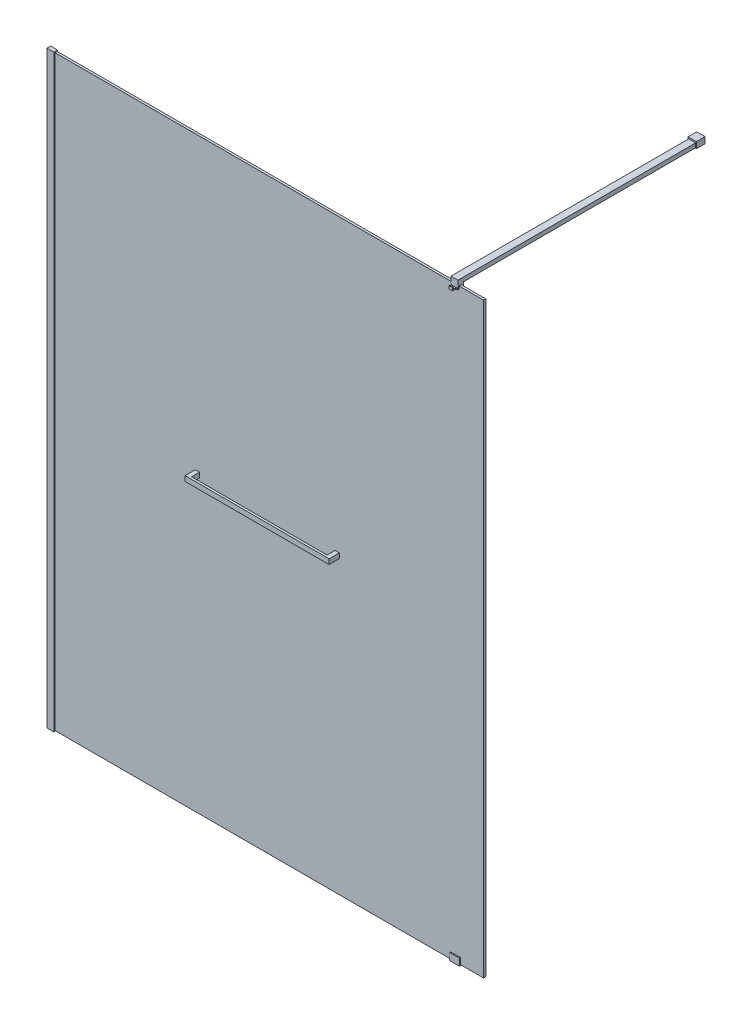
ISO-10303-21;
HEADER;
FILE_DESCRIPTION(('STEP AP214'),'2;1');
FILE_NAME('part.step','',(''),(''),'','','');
FILE_SCHEMA(('AUTOMOTIVE_DESIGN { 1 0 10303 214 1 1 1 1 }'));
ENDSEC;
DATA;
#1=APPLICATION_CONTEXT('core data for automotive mechanical design processes');
#2=APPLICATION_PROTOCOL_DEFINITION('international standard','automotive_design',2000,#1);
#3=PRODUCT_CONTEXT('',#1,'mechanical');
#4=PRODUCT('Part','Part','',(#3));
#5=PRODUCT_RELATED_PRODUCT_CATEGORY('part','',(#4));
#6=PRODUCT_DEFINITION_FORMATION('','',#4);
#7=PRODUCT_DEFINITION_CONTEXT('part definition',#1,'design');
#8=PRODUCT_DEFINITION('design','',#6,#7);
#9=PRODUCT_DEFINITION_SHAPE('','',#8);
#10=(LENGTH_UNIT() NAMED_UNIT(*) SI_UNIT(.MILLI.,.METRE.));
#11=(NAMED_UNIT(*) PLANE_ANGLE_UNIT() SI_UNIT($,.RADIAN.));
#12=(NAMED_UNIT(*) SI_UNIT($,.STERADIAN.) SOLID_ANGLE_UNIT());
#13=UNCERTAINTY_MEASURE_WITH_UNIT(LENGTH_MEASURE(1.E-05),#10,'distance_accuracy_value','');
#14=(GEOMETRIC_REPRESENTATION_CONTEXT(3) GLOBAL_UNCERTAINTY_ASSIGNED_CONTEXT((#13)) GLOBAL_UNIT_ASSIGNED_CONTEXT((#10,
#11,#12)) REPRESENTATION_CONTEXT('',''));
#15=CARTESIAN_POINT('',(0.,0.,0.));
#16=DIRECTION('',(0.,0.,1.));
#17=DIRECTION('',(1.,0.,0.));
#18=AXIS2_PLACEMENT_3D('',#15,#16,#17);
#19=CARTESIAN_POINT('',(1042.45,1045.72,-21.6));
#20=DIRECTION('',(1.,0.,0.));
#21=DIRECTION('',(0.,0.,-1.));
#22=AXIS2_PLACEMENT_3D('',#19,#20,#21);
#23=PLANE('',#22);
#24=DIRECTION('',(0.,0.,-1.));
#25=VECTOR('',#24,1.);
#26=CARTESIAN_POINT('',(1042.45,1053.72,-21.6));
#27=LINE('',#26,#25);
#28=CARTESIAN_POINT('',(1042.45,1053.72,-21.6));
#29=VERTEX_POINT('',#28);
#30=CARTESIAN_POINT('',(1042.45,1053.72,-101.6));
#31=VERTEX_POINT('',#30);
#32=EDGE_CURVE('E110',#29,#31,#27,.T.);
#33=ORIENTED_EDGE('',*,*,#32,.F.);
#34=DIRECTION('',(0.,1.,0.));
#35=VECTOR('',#34,1.);
#36=CARTESIAN_POINT('',(1042.45,1045.72,-21.6));
#37=LINE('',#36,#35);
#38=CARTESIAN_POINT('',(1042.45,1045.72,-21.6));
#39=VERTEX_POINT('',#38);
#40=EDGE_CURVE('E12',#39,#29,#37,.T.);
#41=ORIENTED_EDGE('',*,*,#40,.F.);
#42=DIRECTION('',(0.,0.,-1.));
#43=VECTOR('',#42,1.);
#44=CARTESIAN_POINT('',(1042.45,1045.72,-21.6));
#45=LINE('',#44,#43);
#46=CARTESIAN_POINT('',(1042.45,1045.72,-101.6));
#47=VERTEX_POINT('',#46);
#48=EDGE_CURVE('E104',#39,#47,#45,.T.);
#49=ORIENTED_EDGE('',*,*,#48,.T.);
#50=DIRECTION('',(0.,1.,0.));
#51=VECTOR('',#50,1.);
#52=CARTESIAN_POINT('',(1042.45,1045.72,-101.6));
#53=LINE('',#52,#51);
#54=EDGE_CURVE('E49',#47,#31,#53,.T.);
#55=ORIENTED_EDGE('',*,*,#54,.T.);
#56=EDGE_LOOP('',(#33,#41,#49,#55));
#57=FACE_BOUND('',#56,.T.);
#58=ADVANCED_FACE('F46',(#57),#23,.T.);
#59=CARTESIAN_POINT('',(1042.45,1045.72,-21.6));
#60=DIRECTION('',(0.,0.,1.));
#61=DIRECTION('',(1.,0.,0.));
#62=AXIS2_PLACEMENT_3D('',#59,#60,#61);
#63=PLANE('',#62);
#64=DIRECTION('',(1.,0.,0.));
#65=VECTOR('',#64,1.);
#66=CARTESIAN_POINT('',(1042.45,1053.72,-21.6));
#67=LINE('',#66,#65);
#68=CARTESIAN_POINT('',(527.45,1053.72,-21.5999999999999));
#69=VERTEX_POINT('',#68);
#70=EDGE_CURVE('E106',#69,#29,#67,.T.);
#71=ORIENTED_EDGE('',*,*,#70,.F.);
#72=DIRECTION('',(0.,1.,0.));
#73=VECTOR('',#72,1.);
#74=CARTESIAN_POINT('',(527.45,1045.72,-21.5999999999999));
#75=LINE('',#74,#73);
#76=CARTESIAN_POINT('',(527.45,1045.72,-21.5999999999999));
#77=VERTEX_POINT('',#76);
#78=EDGE_CURVE('E55',#77,#69,#75,.T.);
#79=ORIENTED_EDGE('',*,*,#78,.F.);
#80=DIRECTION('',(1.,0.,0.));
#81=VECTOR('',#80,1.);
#82=CARTESIAN_POINT('',(1042.45,1045.72,-21.6));
#83=LINE('',#82,#81);
#84=EDGE_CURVE('E101',#77,#39,#83,.T.);
#85=ORIENTED_EDGE('',*,*,#84,.T.);
#86=ORIENTED_EDGE('',*,*,#40,.T.);
#87=EDGE_LOOP('',(#71,#79,#85,#86));
#88=FACE_BOUND('',#87,.T.);
#89=ADVANCED_FACE('F120',(#88),#63,.T.);
#90=CARTESIAN_POINT('',(527.45,1045.72,-21.5999999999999));
#91=DIRECTION('',(-1.,0.,0.));
#92=DIRECTION('',(0.,0.,1.));
#93=AXIS2_PLACEMENT_3D('',#90,#91,#92);
#94=PLANE('',#93);
#95=DIRECTION('',(0.,0.,1.));
#96=VECTOR('',#95,1.);
#97=CARTESIAN_POINT('',(527.45,1053.72,-21.5999999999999));
#98=LINE('',#97,#96);
#99=CARTESIAN_POINT('',(527.45,1053.72,-101.6));
#100=VERTEX_POINT('',#99);
#101=EDGE_CURVE('E96',#100,#69,#98,.T.);
#102=ORIENTED_EDGE('',*,*,#101,.F.);
#103=DIRECTION('',(0.,1.,0.));
#104=VECTOR('',#103,1.);
#105=CARTESIAN_POINT('',(527.45,1045.72,-101.6));
#106=LINE('',#105,#104);
#107=CARTESIAN_POINT('',(527.45,1045.72,-101.6));
#108=VERTEX_POINT('',#107);
#109=EDGE_CURVE('E91',#108,#100,#106,.T.);
#110=ORIENTED_EDGE('',*,*,#109,.F.);
#111=DIRECTION('',(0.,0.,1.));
#112=VECTOR('',#111,1.);
#113=CARTESIAN_POINT('',(527.45,1045.72,-21.5999999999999));
#114=LINE('',#113,#112);
#115=EDGE_CURVE('E94',#108,#77,#114,.T.);
#116=ORIENTED_EDGE('',*,*,#115,.T.);
#117=ORIENTED_EDGE('',*,*,#78,.T.);
#118=EDGE_LOOP('',(#102,#110,#116,#117));
#119=FACE_BOUND('',#118,.T.);
#120=ADVANCED_FACE('F93',(#119),#94,.T.);
#121=CARTESIAN_POINT('',(1042.45,1045.72,-101.6));
#122=DIRECTION('',(0.,0.,-1.));
#123=DIRECTION('',(-1.,0.,0.));
#124=AXIS2_PLACEMENT_3D('',#121,#122,#123);
#125=PLANE('',#124);
#126=DIRECTION('',(-1.,0.,0.));
#127=VECTOR('',#126,1.);
#128=CARTESIAN_POINT('',(1042.45,1053.72,-101.6));
#129=LINE('',#128,#127);
#130=EDGE_CURVE('E113',#31,#100,#129,.T.);
#131=ORIENTED_EDGE('',*,*,#130,.F.);
#132=ORIENTED_EDGE('',*,*,#54,.F.);
#133=DIRECTION('',(-1.,0.,0.));
#134=VECTOR('',#133,1.);
#135=CARTESIAN_POINT('',(1042.45,1045.72,-101.6));
#136=LINE('',#135,#134);
#137=EDGE_CURVE('E100',#47,#108,#136,.T.);
#138=ORIENTED_EDGE('',*,*,#137,.T.);
#139=ORIENTED_EDGE('',*,*,#109,.T.);
#140=EDGE_LOOP('',(#131,#132,#138,#139));
#141=FACE_BOUND('',#140,.T.);
#142=ADVANCED_FACE('F103',(#141),#125,.T.);
#143=CARTESIAN_POINT('',(1042.45,1045.72,-101.6));
#144=DIRECTION('',(0.,1.,0.));
#145=DIRECTION('',(0.,0.,1.));
#146=AXIS2_PLACEMENT_3D('',#143,#144,#145);
#147=PLANE('',#146);
#148=ORIENTED_EDGE('',*,*,#48,.F.);
#149=ORIENTED_EDGE('',*,*,#84,.F.);
#150=ORIENTED_EDGE('',*,*,#115,.F.);
#151=ORIENTED_EDGE('',*,*,#137,.F.);
#152=EDGE_LOOP('',(#148,#149,#150,#151));
#153=FACE_BOUND('',#152,.T.);
#154=ADVANCED_FACE('F99',(#153),#147,.F.);
#155=CARTESIAN_POINT('',(1042.45,1053.72,-101.6));
#156=DIRECTION('',(0.,1.,0.));
#157=DIRECTION('',(0.,0.,1.));
#158=AXIS2_PLACEMENT_3D('',#155,#156,#157);
#159=PLANE('',#158);
#160=ORIENTED_EDGE('',*,*,#32,.T.);
#161=ORIENTED_EDGE('',*,*,#130,.T.);
#162=ORIENTED_EDGE('',*,*,#101,.T.);
#163=ORIENTED_EDGE('',*,*,#70,.T.);
#164=EDGE_LOOP('',(#160,#161,#162,#163));
#165=FACE_BOUND('',#164,.T.);
#166=ADVANCED_FACE('F119',(#165),#159,.T.);
#167=CLOSED_SHELL('',(#58,#89,#120,#142,#154,#166));
#168=MANIFOLD_SOLID_BREP('B2',#167);
#169=CARTESIAN_POINT('',(542.45,1041.,-34.4));
#170=DIRECTION('',(0.,0.,1.));
#171=DIRECTION('',(1.,0.,0.));
#172=AXIS2_PLACEMENT_3D('',#169,#170,#171);
#173=PLANE('',#172);
#174=DIRECTION('',(0.,-1.,0.));
#175=VECTOR('',#174,1.);
#176=CARTESIAN_POINT('',(527.45,1059.,-34.4));
#177=LINE('',#176,#175);
#178=CARTESIAN_POINT('',(527.45,1045.73,-34.4));
#179=VERTEX_POINT('',#178);
#180=CARTESIAN_POINT('',(527.45,1041.,-34.4));
#181=VERTEX_POINT('',#180);
#182=EDGE_CURVE('E415',#179,#181,#177,.T.);
#183=ORIENTED_EDGE('',*,*,#182,.F.);
#184=DIRECTION('',(1.,0.,0.));
#185=VECTOR('',#184,1.);
#186=CARTESIAN_POINT('',(542.45,1045.73,-34.4));
#187=LINE('',#186,#185);
#188=CARTESIAN_POINT('',(542.45,1045.73,-34.4));
#189=VERTEX_POINT('',#188);
#190=EDGE_CURVE('E44',#179,#189,#187,.T.);
#191=ORIENTED_EDGE('',*,*,#190,.T.);
#192=DIRECTION('',(0.,1.,0.));
#193=VECTOR('',#192,1.);
#194=CARTESIAN_POINT('',(542.45,1059.,-34.4));
#195=LINE('',#194,#193);
#196=CARTESIAN_POINT('',(542.45,1041.,-34.4));
#197=VERTEX_POINT('',#196);
#198=EDGE_CURVE('E420',#197,#189,#195,.T.);
#199=ORIENTED_EDGE('',*,*,#198,.F.);
#200=DIRECTION('',(1.,0.,0.));
#201=VECTOR('',#200,1.);
#202=CARTESIAN_POINT('',(527.45,1041.,-34.4));
#203=LINE('',#202,#201);
#204=EDGE_CURVE('E394',#181,#197,#203,.T.);
#205=ORIENTED_EDGE('',*,*,#204,.F.);
#206=EDGE_LOOP('',(#183,#191,#199,#205));
#207=FACE_BOUND('',#206,.T.);
#208=ADVANCED_FACE('F180',(#207),#173,.F.);
#209=CARTESIAN_POINT('',(542.45,1059.,-34.4));
#210=DIRECTION('',(1.,0.,0.));
#211=DIRECTION('',(0.,0.,-1.));
#212=AXIS2_PLACEMENT_3D('',#209,#210,#211);
#213=PLANE('',#212);
#214=DIRECTION('',(0.,1.,0.));
#215=VECTOR('',#214,1.);
#216=CARTESIAN_POINT('',(542.45,1059.,25.1));
#217=LINE('',#216,#215);
#218=CARTESIAN_POINT('',(542.45,1041.,25.1));
#219=VERTEX_POINT('',#218);
#220=CARTESIAN_POINT('',(542.45,1059.,25.1));
#221=VERTEX_POINT('',#220);
#222=EDGE_CURVE('E198',#219,#221,#217,.T.);
#223=ORIENTED_EDGE('',*,*,#222,.F.);
#224=DIRECTION('',(0.,0.,1.));
#225=VECTOR('',#224,1.);
#226=CARTESIAN_POINT('',(542.45,1041.,-34.4));
#227=LINE('',#226,#225);
#228=EDGE_CURVE('E385',#197,#219,#227,.T.);
#229=ORIENTED_EDGE('',*,*,#228,.F.);
#230=ORIENTED_EDGE('',*,*,#198,.T.);
#231=DIRECTION('',(0.,0.,-1.));
#232=VECTOR('',#231,1.);
#233=CARTESIAN_POINT('',(542.45,1045.73,-34.4));
#234=LINE('',#233,#232);
#235=CARTESIAN_POINT('',(542.45,1045.73,-21.6));
#236=VERTEX_POINT('',#235);
#237=EDGE_CURVE('E433',#236,#189,#234,.T.);
#238=ORIENTED_EDGE('',*,*,#237,.F.);
#239=DIRECTION('',(0.,-1.,0.));
#240=VECTOR('',#239,1.);
#241=CARTESIAN_POINT('',(542.45,1059.,-21.6));
#242=LINE('',#241,#240);
#243=CARTESIAN_POINT('',(542.45,1053.73,-21.6));
#244=VERTEX_POINT('',#243);
#245=EDGE_CURVE('E431',#244,#236,#242,.T.);
#246=ORIENTED_EDGE('',*,*,#245,.F.);
#247=DIRECTION('',(0.,0.,1.));
#248=VECTOR('',#247,1.);
#249=CARTESIAN_POINT('',(542.45,1053.73,-34.4));
#250=LINE('',#249,#248);
#251=CARTESIAN_POINT('',(542.45,1053.73,-34.4));
#252=VERTEX_POINT('',#251);
#253=EDGE_CURVE('E435',#252,#244,#250,.T.);
#254=ORIENTED_EDGE('',*,*,#253,.F.);
#255=CARTESIAN_POINT('',(542.45,1059.,-34.4));
#256=VERTEX_POINT('',#255);
#257=EDGE_CURVE('E408',#252,#256,#195,.T.);
#258=ORIENTED_EDGE('',*,*,#257,.T.);
#259=DIRECTION('',(0.,0.,1.));
#260=VECTOR('',#259,1.);
#261=CARTESIAN_POINT('',(542.45,1059.,-34.4));
#262=LINE('',#261,#260);
#263=EDGE_CURVE('E389',#256,#221,#262,.T.);
#264=ORIENTED_EDGE('',*,*,#263,.T.);
#265=EDGE_LOOP('',(#223,#229,#230,#238,#246,#254,#258,#264));
#266=FACE_BOUND('',#265,.T.);
#267=ADVANCED_FACE('F182',(#266),#213,.T.);
#268=CARTESIAN_POINT('',(527.45,1041.,-34.4));
#269=DIRECTION('',(0.,-1.,0.));
#270=DIRECTION('',(0.,0.,-1.));
#271=AXIS2_PLACEMENT_3D('',#268,#269,#270);
#272=PLANE('',#271);
#273=ORIENTED_EDGE('',*,*,#228,.T.);
#274=DIRECTION('',(-1.,0.,0.));
#275=VECTOR('',#274,1.);
#276=CARTESIAN_POINT('',(1047.14771560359,1041.,25.1));
#277=LINE('',#276,#275);
#278=CARTESIAN_POINT('',(1027.45,1041.,25.1));
#279=VERTEX_POINT('',#278);
#280=EDGE_CURVE('E373',#279,#219,#277,.T.);
#281=ORIENTED_EDGE('',*,*,#280,.F.);
#282=DIRECTION('',(0.,0.,1.));
#283=VECTOR('',#282,1.);
#284=CARTESIAN_POINT('',(1027.45,1041.,-34.4));
#285=LINE('',#284,#283);
#286=CARTESIAN_POINT('',(1027.45,1041.,-34.4));
#287=VERTEX_POINT('',#286);
#288=EDGE_CURVE('E352',#287,#279,#285,.T.);
#289=ORIENTED_EDGE('',*,*,#288,.F.);
#290=DIRECTION('',(1.,0.,0.));
#291=VECTOR('',#290,1.);
#292=CARTESIAN_POINT('',(1027.45,1041.,-34.4));
#293=LINE('',#292,#291);
#294=CARTESIAN_POINT('',(1042.45,1041.,-34.4));
#295=VERTEX_POINT('',#294);
#296=EDGE_CURVE('E344',#287,#295,#293,.T.);
#297=ORIENTED_EDGE('',*,*,#296,.T.);
#298=DIRECTION('',(0.,0.,1.));
#299=VECTOR('',#298,1.);
#300=CARTESIAN_POINT('',(1042.45,1041.,-34.4));
#301=LINE('',#300,#299);
#302=CARTESIAN_POINT('',(1042.45,1041.,33.1));
#303=VERTEX_POINT('',#302);
#304=EDGE_CURVE('E348',#295,#303,#301,.T.);
#305=ORIENTED_EDGE('',*,*,#304,.T.);
#306=DIRECTION('',(1.,0.,0.));
#307=VECTOR('',#306,1.);
#308=CARTESIAN_POINT('',(527.45,1041.,33.1));
#309=LINE('',#308,#307);
#310=CARTESIAN_POINT('',(527.45,1041.,33.1));
#311=VERTEX_POINT('',#310);
#312=EDGE_CURVE('E423',#311,#303,#309,.T.);
#313=ORIENTED_EDGE('',*,*,#312,.F.);
#314=DIRECTION('',(0.,0.,1.));
#315=VECTOR('',#314,1.);
#316=CARTESIAN_POINT('',(527.45,1041.,-34.4));
#317=LINE('',#316,#315);
#318=EDGE_CURVE('E388',#181,#311,#317,.T.);
#319=ORIENTED_EDGE('',*,*,#318,.F.);
#320=ORIENTED_EDGE('',*,*,#204,.T.);
#321=EDGE_LOOP('',(#273,#281,#289,#297,#305,#313,#319,#320));
#322=FACE_BOUND('',#321,.T.);
#323=ADVANCED_FACE('F456',(#322),#272,.T.);
#324=CARTESIAN_POINT('',(527.45,1059.,-34.4));
#325=DIRECTION('',(-1.,0.,0.));
#326=DIRECTION('',(0.,0.,1.));
#327=AXIS2_PLACEMENT_3D('',#324,#325,#326);
#328=PLANE('',#327);
#329=DIRECTION('',(0.,0.,1.));
#330=VECTOR('',#329,1.);
#331=CARTESIAN_POINT('',(527.45,1045.73,-34.4));
#332=LINE('',#331,#330);
#333=CARTESIAN_POINT('',(527.45,1045.73,-21.6));
#334=VERTEX_POINT('',#333);
#335=EDGE_CURVE('E379',#179,#334,#332,.T.);
#336=ORIENTED_EDGE('',*,*,#335,.F.);
#337=ORIENTED_EDGE('',*,*,#182,.T.);
#338=ORIENTED_EDGE('',*,*,#318,.T.);
#339=DIRECTION('',(0.,-1.,0.));
#340=VECTOR('',#339,1.);
#341=CARTESIAN_POINT('',(527.45,1059.,33.1));
#342=LINE('',#341,#340);
#343=CARTESIAN_POINT('',(527.45,1059.,33.1));
#344=VERTEX_POINT('',#343);
#345=EDGE_CURVE('E425',#344,#311,#342,.T.);
#346=ORIENTED_EDGE('',*,*,#345,.F.);
#347=DIRECTION('',(0.,0.,1.));
#348=VECTOR('',#347,1.);
#349=CARTESIAN_POINT('',(527.45,1059.,-34.4));
#350=LINE('',#349,#348);
#351=CARTESIAN_POINT('',(527.45,1059.,-34.4));
#352=VERTEX_POINT('',#351);
#353=EDGE_CURVE('E397',#352,#344,#350,.T.);
#354=ORIENTED_EDGE('',*,*,#353,.F.);
#355=CARTESIAN_POINT('',(527.45,1053.73,-34.4));
#356=VERTEX_POINT('',#355);
#357=EDGE_CURVE('E406',#352,#356,#177,.T.);
#358=ORIENTED_EDGE('',*,*,#357,.T.);
#359=DIRECTION('',(0.,0.,-1.));
#360=VECTOR('',#359,1.);
#361=CARTESIAN_POINT('',(527.45,1053.73,-34.4));
#362=LINE('',#361,#360);
#363=CARTESIAN_POINT('',(527.45,1053.73,-21.6));
#364=VERTEX_POINT('',#363);
#365=EDGE_CURVE('E206',#364,#356,#362,.T.);
#366=ORIENTED_EDGE('',*,*,#365,.F.);
#367=DIRECTION('',(0.,1.,0.));
#368=VECTOR('',#367,1.);
#369=CARTESIAN_POINT('',(527.45,1053.73,-21.6));
#370=LINE('',#369,#368);
#371=EDGE_CURVE('E442',#334,#364,#370,.T.);
#372=ORIENTED_EDGE('',*,*,#371,.F.);
#373=EDGE_LOOP('',(#336,#337,#338,#346,#354,#358,#366,#372));
#374=FACE_BOUND('',#373,.T.);
#375=ADVANCED_FACE('F412',(#374),#328,.T.);
#376=CARTESIAN_POINT('',(527.45,1059.,-34.4));
#377=DIRECTION('',(0.,1.,0.));
#378=DIRECTION('',(0.,0.,1.));
#379=AXIS2_PLACEMENT_3D('',#376,#377,#378);
#380=PLANE('',#379);
#381=ORIENTED_EDGE('',*,*,#353,.T.);
#382=DIRECTION('',(-1.,0.,0.));
#383=VECTOR('',#382,1.);
#384=CARTESIAN_POINT('',(527.45,1059.,33.1));
#385=LINE('',#384,#383);
#386=CARTESIAN_POINT('',(1042.45,1059.,33.1));
#387=VERTEX_POINT('',#386);
#388=EDGE_CURVE('E428',#387,#344,#385,.T.);
#389=ORIENTED_EDGE('',*,*,#388,.F.);
#390=DIRECTION('',(0.,0.,1.));
#391=VECTOR('',#390,1.);
#392=CARTESIAN_POINT('',(1042.45,1059.,-34.4));
#393=LINE('',#392,#391);
#394=CARTESIAN_POINT('',(1042.45,1059.,-34.4));
#395=VERTEX_POINT('',#394);
#396=EDGE_CURVE('E347',#395,#387,#393,.T.);
#397=ORIENTED_EDGE('',*,*,#396,.F.);
#398=DIRECTION('',(-1.,0.,0.));
#399=VECTOR('',#398,1.);
#400=CARTESIAN_POINT('',(1027.45,1059.,-34.4));
#401=LINE('',#400,#399);
#402=CARTESIAN_POINT('',(1027.45,1059.,-34.4));
#403=VERTEX_POINT('',#402);
#404=EDGE_CURVE('E337',#395,#403,#401,.T.);
#405=ORIENTED_EDGE('',*,*,#404,.T.);
#406=DIRECTION('',(0.,0.,1.));
#407=VECTOR('',#406,1.);
#408=CARTESIAN_POINT('',(1027.45,1059.,-34.4));
#409=LINE('',#408,#407);
#410=CARTESIAN_POINT('',(1027.45,1059.,25.1));
#411=VERTEX_POINT('',#410);
#412=EDGE_CURVE('E360',#403,#411,#409,.T.);
#413=ORIENTED_EDGE('',*,*,#412,.T.);
#414=DIRECTION('',(-1.,0.,0.));
#415=VECTOR('',#414,1.);
#416=CARTESIAN_POINT('',(1047.14771560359,1059.,25.1));
#417=LINE('',#416,#415);
#418=EDGE_CURVE('E370',#411,#221,#417,.T.);
#419=ORIENTED_EDGE('',*,*,#418,.T.);
#420=ORIENTED_EDGE('',*,*,#263,.F.);
#421=DIRECTION('',(-1.,0.,0.));
#422=VECTOR('',#421,1.);
#423=CARTESIAN_POINT('',(527.45,1059.,-34.4));
#424=LINE('',#423,#422);
#425=EDGE_CURVE('E417',#256,#352,#424,.T.);
#426=ORIENTED_EDGE('',*,*,#425,.T.);
#427=EDGE_LOOP('',(#381,#389,#397,#405,#413,#419,#420,#426));
#428=FACE_BOUND('',#427,.T.);
#429=ADVANCED_FACE('F463',(#428),#380,.T.);
#430=ORIENTED_EDGE('',*,*,#257,.F.);
#431=DIRECTION('',(-1.,0.,0.));
#432=VECTOR('',#431,1.);
#433=CARTESIAN_POINT('',(542.45,1053.73,-34.4));
#434=LINE('',#433,#432);
#435=EDGE_CURVE('E190',#252,#356,#434,.T.);
#436=ORIENTED_EDGE('',*,*,#435,.T.);
#437=ORIENTED_EDGE('',*,*,#357,.F.);
#438=ORIENTED_EDGE('',*,*,#425,.F.);
#439=EDGE_LOOP('',(#430,#436,#437,#438));
#440=FACE_BOUND('',#439,.T.);
#441=ADVANCED_FACE('F404',(#440),#173,.F.);
#442=CARTESIAN_POINT('',(542.45,1041.,33.1));
#443=DIRECTION('',(0.,0.,1.));
#444=DIRECTION('',(1.,0.,0.));
#445=AXIS2_PLACEMENT_3D('',#442,#443,#444);
#446=PLANE('',#445);
#447=ORIENTED_EDGE('',*,*,#312,.T.);
#448=DIRECTION('',(0.,1.,0.));
#449=VECTOR('',#448,1.);
#450=CARTESIAN_POINT('',(1042.45,1059.,33.1));
#451=LINE('',#450,#449);
#452=EDGE_CURVE('E332',#303,#387,#451,.T.);
#453=ORIENTED_EDGE('',*,*,#452,.T.);
#454=ORIENTED_EDGE('',*,*,#388,.T.);
#455=ORIENTED_EDGE('',*,*,#345,.T.);
#456=EDGE_LOOP('',(#447,#453,#454,#455));
#457=FACE_BOUND('',#456,.T.);
#458=ADVANCED_FACE('F459',(#457),#446,.T.);
#459=CARTESIAN_POINT('',(1057.54436981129,1045.73,-34.4));
#460=DIRECTION('',(0.,-1.,0.));
#461=DIRECTION('',(0.,0.,-1.));
#462=AXIS2_PLACEMENT_3D('',#459,#460,#461);
#463=PLANE('',#462);
#464=ORIENTED_EDGE('',*,*,#237,.T.);
#465=ORIENTED_EDGE('',*,*,#190,.F.);
#466=ORIENTED_EDGE('',*,*,#335,.T.);
#467=DIRECTION('',(-1.,0.,0.));
#468=VECTOR('',#467,1.);
#469=CARTESIAN_POINT('',(1057.54436981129,1045.73,-21.6));
#470=LINE('',#469,#468);
#471=EDGE_CURVE('E438',#236,#334,#470,.T.);
#472=ORIENTED_EDGE('',*,*,#471,.F.);
#473=EDGE_LOOP('',(#464,#465,#466,#472));
#474=FACE_BOUND('',#473,.T.);
#475=ADVANCED_FACE('F498',(#474),#463,.F.);
#476=CARTESIAN_POINT('',(1057.54436981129,1053.73,-21.6));
#477=DIRECTION('',(0.,0.,1.));
#478=DIRECTION('',(1.,0.,0.));
#479=AXIS2_PLACEMENT_3D('',#476,#477,#478);
#480=PLANE('',#479);
#481=ORIENTED_EDGE('',*,*,#245,.T.);
#482=ORIENTED_EDGE('',*,*,#471,.T.);
#483=ORIENTED_EDGE('',*,*,#371,.T.);
#484=DIRECTION('',(-1.,0.,0.));
#485=VECTOR('',#484,1.);
#486=CARTESIAN_POINT('',(1057.54436981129,1053.73,-21.6));
#487=LINE('',#486,#485);
#488=EDGE_CURVE('E437',#244,#364,#487,.T.);
#489=ORIENTED_EDGE('',*,*,#488,.F.);
#490=EDGE_LOOP('',(#481,#482,#483,#489));
#491=FACE_BOUND('',#490,.T.);
#492=ADVANCED_FACE('F446',(#491),#480,.F.);
#493=CARTESIAN_POINT('',(1057.54436981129,1053.73,-34.4));
#494=DIRECTION('',(0.,1.,0.));
#495=DIRECTION('',(0.,0.,1.));
#496=AXIS2_PLACEMENT_3D('',#493,#494,#495);
#497=PLANE('',#496);
#498=ORIENTED_EDGE('',*,*,#253,.T.);
#499=ORIENTED_EDGE('',*,*,#488,.T.);
#500=ORIENTED_EDGE('',*,*,#365,.T.);
#501=ORIENTED_EDGE('',*,*,#435,.F.);
#502=EDGE_LOOP('',(#498,#499,#500,#501));
#503=FACE_BOUND('',#502,.T.);
#504=ADVANCED_FACE('F538',(#503),#497,.F.);
#505=CARTESIAN_POINT('',(1047.14771560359,1059.,25.1));
#506=DIRECTION('',(0.,0.,1.));
#507=DIRECTION('',(0.,-1.,0.));
#508=AXIS2_PLACEMENT_3D('',#505,#506,#507);
#509=PLANE('',#508);
#510=ORIENTED_EDGE('',*,*,#418,.F.);
#511=DIRECTION('',(0.,-1.,0.));
#512=VECTOR('',#511,1.);
#513=CARTESIAN_POINT('',(1027.45,1059.,25.1));
#514=LINE('',#513,#512);
#515=EDGE_CURVE('E184',#411,#279,#514,.T.);
#516=ORIENTED_EDGE('',*,*,#515,.T.);
#517=ORIENTED_EDGE('',*,*,#280,.T.);
#518=ORIENTED_EDGE('',*,*,#222,.T.);
#519=EDGE_LOOP('',(#510,#516,#517,#518));
#520=FACE_BOUND('',#519,.T.);
#521=ADVANCED_FACE('F470',(#520),#509,.F.);
#522=CARTESIAN_POINT('',(1027.45,1059.,-34.4));
#523=DIRECTION('',(-1.,0.,0.));
#524=DIRECTION('',(0.,0.,1.));
#525=AXIS2_PLACEMENT_3D('',#522,#523,#524);
#526=PLANE('',#525);
#527=ORIENTED_EDGE('',*,*,#515,.F.);
#528=ORIENTED_EDGE('',*,*,#412,.F.);
#529=DIRECTION('',(0.,-1.,0.));
#530=VECTOR('',#529,1.);
#531=CARTESIAN_POINT('',(1027.45,1059.,-34.4));
#532=LINE('',#531,#530);
#533=CARTESIAN_POINT('',(1027.45,1053.73,-34.4));
#534=VERTEX_POINT('',#533);
#535=EDGE_CURVE('E341',#403,#534,#532,.T.);
#536=ORIENTED_EDGE('',*,*,#535,.T.);
#537=DIRECTION('',(0.,0.,-1.));
#538=VECTOR('',#537,1.);
#539=CARTESIAN_POINT('',(1027.45,1053.73,-34.4));
#540=LINE('',#539,#538);
#541=CARTESIAN_POINT('',(1027.45,1053.73,-21.6));
#542=VERTEX_POINT('',#541);
#543=EDGE_CURVE('E329',#542,#534,#540,.T.);
#544=ORIENTED_EDGE('',*,*,#543,.F.);
#545=DIRECTION('',(0.,1.,0.));
#546=VECTOR('',#545,1.);
#547=CARTESIAN_POINT('',(1027.45,1059.,-21.6));
#548=LINE('',#547,#546);
#549=CARTESIAN_POINT('',(1027.45,1045.73,-21.6));
#550=VERTEX_POINT('',#549);
#551=EDGE_CURVE('E351',#550,#542,#548,.T.);
#552=ORIENTED_EDGE('',*,*,#551,.F.);
#553=DIRECTION('',(0.,0.,1.));
#554=VECTOR('',#553,1.);
#555=CARTESIAN_POINT('',(1027.45,1045.73,-34.4));
#556=LINE('',#555,#554);
#557=CARTESIAN_POINT('',(1027.45,1045.73,-34.4));
#558=VERTEX_POINT('',#557);
#559=EDGE_CURVE('E313',#558,#550,#556,.T.);
#560=ORIENTED_EDGE('',*,*,#559,.F.);
#561=EDGE_CURVE('E340',#558,#287,#532,.T.);
#562=ORIENTED_EDGE('',*,*,#561,.T.);
#563=ORIENTED_EDGE('',*,*,#288,.T.);
#564=EDGE_LOOP('',(#527,#528,#536,#544,#552,#560,#562,#563));
#565=FACE_BOUND('',#564,.T.);
#566=ADVANCED_FACE('F471',(#565),#526,.T.);
#567=CARTESIAN_POINT('',(1042.45,1041.,-34.4));
#568=DIRECTION('',(0.,0.,1.));
#569=DIRECTION('',(1.,0.,0.));
#570=AXIS2_PLACEMENT_3D('',#567,#568,#569);
#571=PLANE('',#570);
#572=ORIENTED_EDGE('',*,*,#561,.F.);
#573=DIRECTION('',(-1.,0.,0.));
#574=VECTOR('',#573,1.);
#575=CARTESIAN_POINT('',(1057.54436981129,1045.73,-34.4));
#576=LINE('',#575,#574);
#577=CARTESIAN_POINT('',(1042.45,1045.73,-34.4));
#578=VERTEX_POINT('',#577);
#579=EDGE_CURVE('E326',#578,#558,#576,.T.);
#580=ORIENTED_EDGE('',*,*,#579,.F.);
#581=DIRECTION('',(0.,1.,0.));
#582=VECTOR('',#581,1.);
#583=CARTESIAN_POINT('',(1042.45,1059.,-34.4));
#584=LINE('',#583,#582);
#585=EDGE_CURVE('E318',#295,#578,#584,.T.);
#586=ORIENTED_EDGE('',*,*,#585,.F.);
#587=ORIENTED_EDGE('',*,*,#296,.F.);
#588=EDGE_LOOP('',(#572,#580,#586,#587));
#589=FACE_BOUND('',#588,.T.);
#590=ADVANCED_FACE('F476',(#589),#571,.F.);
#591=CARTESIAN_POINT('',(1042.45,1059.,-34.4));
#592=DIRECTION('',(1.,0.,0.));
#593=DIRECTION('',(0.,0.,-1.));
#594=AXIS2_PLACEMENT_3D('',#591,#592,#593);
#595=PLANE('',#594);
#596=DIRECTION('',(0.,0.,1.));
#597=VECTOR('',#596,1.);
#598=CARTESIAN_POINT('',(1042.45,1045.73,-34.4));
#599=LINE('',#598,#597);
#600=CARTESIAN_POINT('',(1042.45,1045.73,-21.6));
#601=VERTEX_POINT('',#600);
#602=EDGE_CURVE('E310',#578,#601,#599,.T.);
#603=ORIENTED_EDGE('',*,*,#602,.T.);
#604=DIRECTION('',(0.,1.,0.));
#605=VECTOR('',#604,1.);
#606=CARTESIAN_POINT('',(1042.45,1053.73,-21.6));
#607=LINE('',#606,#605);
#608=CARTESIAN_POINT('',(1042.45,1053.73,-21.6));
#609=VERTEX_POINT('',#608);
#610=EDGE_CURVE('E297',#601,#609,#607,.T.);
#611=ORIENTED_EDGE('',*,*,#610,.T.);
#612=DIRECTION('',(0.,0.,-1.));
#613=VECTOR('',#612,1.);
#614=CARTESIAN_POINT('',(1042.45,1053.73,-34.4));
#615=LINE('',#614,#613);
#616=CARTESIAN_POINT('',(1042.45,1053.73,-34.4));
#617=VERTEX_POINT('',#616);
#618=EDGE_CURVE('E321',#609,#617,#615,.T.);
#619=ORIENTED_EDGE('',*,*,#618,.T.);
#620=EDGE_CURVE('E335',#617,#395,#584,.T.);
#621=ORIENTED_EDGE('',*,*,#620,.T.);
#622=ORIENTED_EDGE('',*,*,#396,.T.);
#623=ORIENTED_EDGE('',*,*,#452,.F.);
#624=ORIENTED_EDGE('',*,*,#304,.F.);
#625=ORIENTED_EDGE('',*,*,#585,.T.);
#626=EDGE_LOOP('',(#603,#611,#619,#621,#622,#623,#624,#625));
#627=FACE_BOUND('',#626,.T.);
#628=ADVANCED_FACE('F316',(#627),#595,.T.);
#629=ORIENTED_EDGE('',*,*,#620,.F.);
#630=DIRECTION('',(-1.,0.,0.));
#631=VECTOR('',#630,1.);
#632=CARTESIAN_POINT('',(1057.54436981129,1053.73,-34.4));
#633=LINE('',#632,#631);
#634=EDGE_CURVE('E322',#617,#534,#633,.T.);
#635=ORIENTED_EDGE('',*,*,#634,.T.);
#636=ORIENTED_EDGE('',*,*,#535,.F.);
#637=ORIENTED_EDGE('',*,*,#404,.F.);
#638=EDGE_LOOP('',(#629,#635,#636,#637));
#639=FACE_BOUND('',#638,.T.);
#640=ADVANCED_FACE('F467',(#639),#571,.F.);
#641=CARTESIAN_POINT('',(1057.54436981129,1045.73,-34.4));
#642=DIRECTION('',(0.,-1.,0.));
#643=DIRECTION('',(0.,0.,-1.));
#644=AXIS2_PLACEMENT_3D('',#641,#642,#643);
#645=PLANE('',#644);
#646=ORIENTED_EDGE('',*,*,#559,.T.);
#647=DIRECTION('',(-1.,0.,0.));
#648=VECTOR('',#647,1.);
#649=CARTESIAN_POINT('',(1057.54436981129,1045.73,-21.6));
#650=LINE('',#649,#648);
#651=EDGE_CURVE('E300',#601,#550,#650,.T.);
#652=ORIENTED_EDGE('',*,*,#651,.F.);
#653=ORIENTED_EDGE('',*,*,#602,.F.);
#654=ORIENTED_EDGE('',*,*,#579,.T.);
#655=EDGE_LOOP('',(#646,#652,#653,#654));
#656=FACE_BOUND('',#655,.T.);
#657=ADVANCED_FACE('F309',(#656),#645,.F.);
#658=CARTESIAN_POINT('',(1057.54436981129,1053.73,-21.6));
#659=DIRECTION('',(0.,0.,1.));
#660=DIRECTION('',(1.,0.,0.));
#661=AXIS2_PLACEMENT_3D('',#658,#659,#660);
#662=PLANE('',#661);
#663=ORIENTED_EDGE('',*,*,#551,.T.);
#664=DIRECTION('',(-1.,0.,0.));
#665=VECTOR('',#664,1.);
#666=CARTESIAN_POINT('',(1057.54436981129,1053.73,-21.6));
#667=LINE('',#666,#665);
#668=EDGE_CURVE('E303',#609,#542,#667,.T.);
#669=ORIENTED_EDGE('',*,*,#668,.F.);
#670=ORIENTED_EDGE('',*,*,#610,.F.);
#671=ORIENTED_EDGE('',*,*,#651,.T.);
#672=EDGE_LOOP('',(#663,#669,#670,#671));
#673=FACE_BOUND('',#672,.T.);
#674=ADVANCED_FACE('F299',(#673),#662,.F.);
#675=CARTESIAN_POINT('',(1057.54436981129,1053.73,-34.4));
#676=DIRECTION('',(0.,1.,0.));
#677=DIRECTION('',(0.,0.,1.));
#678=AXIS2_PLACEMENT_3D('',#675,#676,#677);
#679=PLANE('',#678);
#680=ORIENTED_EDGE('',*,*,#543,.T.);
#681=ORIENTED_EDGE('',*,*,#634,.F.);
#682=ORIENTED_EDGE('',*,*,#618,.F.);
#683=ORIENTED_EDGE('',*,*,#668,.T.);
#684=EDGE_LOOP('',(#680,#681,#682,#683));
#685=FACE_BOUND('',#684,.T.);
#686=ADVANCED_FACE('F479',(#685),#679,.F.);
#687=CLOSED_SHELL('',(#208,#267,#323,#375,#429,#441,#458,#475,#492,#504,#521,#566,#590,#628,
#640,#657,#674,#686));
#688=MANIFOLD_SOLID_BREP('B6',#687);
#689=CARTESIAN_POINT('',(1470.95,2090.,-19.4000000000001));
#690=DIRECTION('',(-1.,0.,0.));
#691=DIRECTION('',(0.,0.,1.));
#692=AXIS2_PLACEMENT_3D('',#689,#690,#691);
#693=PLANE('',#692);
#694=DIRECTION('',(0.,-1.,0.));
#695=VECTOR('',#694,1.);
#696=CARTESIAN_POINT('',(1470.95,2090.,-850.03));
#697=LINE('',#696,#695);
#698=CARTESIAN_POINT('',(1470.95,2120.,-850.03));
#699=VERTEX_POINT('',#698);
#700=CARTESIAN_POINT('',(1470.95,2105.,-850.03));
#701=VERTEX_POINT('',#700);
#702=EDGE_CURVE('E669',#699,#701,#697,.T.);
#703=ORIENTED_EDGE('',*,*,#702,.F.);
#704=DIRECTION('',(0.,0.,1.));
#705=VECTOR('',#704,1.);
#706=CARTESIAN_POINT('',(1470.95,2120.,0.599999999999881));
#707=LINE('',#706,#705);
#708=CARTESIAN_POINT('',(1470.95,2120.,0.599999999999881));
#709=VERTEX_POINT('',#708);
#710=EDGE_CURVE('E994',#699,#709,#707,.T.);
#711=ORIENTED_EDGE('',*,*,#710,.T.);
#712=DIRECTION('',(0.,-1.,0.));
#713=VECTOR('',#712,1.);
#714=CARTESIAN_POINT('',(1470.95,2094.,0.599999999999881));
#715=LINE('',#714,#713);
#716=CARTESIAN_POINT('',(1470.95,2094.,0.599999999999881));
#717=VERTEX_POINT('',#716);
#718=EDGE_CURVE('E996',#709,#717,#715,.T.);
#719=ORIENTED_EDGE('',*,*,#718,.T.);
#720=DIRECTION('',(0.,1.,0.));
#721=VECTOR('',#720,1.);
#722=CARTESIAN_POINT('',(1470.95,2090.,0.599999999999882));
#723=LINE('',#722,#721);
#724=CARTESIAN_POINT('',(1470.95,2090.,0.599999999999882));
#725=VERTEX_POINT('',#724);
#726=EDGE_CURVE('E940',#725,#717,#723,.T.);
#727=ORIENTED_EDGE('',*,*,#726,.F.);
#728=DIRECTION('',(0.,0.,-1.));
#729=VECTOR('',#728,1.);
#730=CARTESIAN_POINT('',(1470.95,2090.,-3.40000000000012));
#731=LINE('',#730,#729);
#732=CARTESIAN_POINT('',(1470.95,2090.,-3.40000000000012));
#733=VERTEX_POINT('',#732);
#734=EDGE_CURVE('E970',#725,#733,#731,.T.);
#735=ORIENTED_EDGE('',*,*,#734,.T.);
#736=DIRECTION('',(0.,1.,-1.30407837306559E-13));
#737=VECTOR('',#736,1.);
#738=CARTESIAN_POINT('',(1470.95,2100.,-3.40000000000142));
#739=LINE('',#738,#737);
#740=CARTESIAN_POINT('',(1470.95,2100.,-3.40000000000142));
#741=VERTEX_POINT('',#740);
#742=EDGE_CURVE('E1000',#733,#741,#739,.T.);
#743=ORIENTED_EDGE('',*,*,#742,.T.);
#744=DIRECTION('',(0.,0.,-1.));
#745=VECTOR('',#744,1.);
#746=CARTESIAN_POINT('',(1470.95,2100.,-11.4000000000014));
#747=LINE('',#746,#745);
#748=CARTESIAN_POINT('',(1470.95,2100.,-11.4000000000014));
#749=VERTEX_POINT('',#748);
#750=EDGE_CURVE('E1002',#741,#749,#747,.T.);
#751=ORIENTED_EDGE('',*,*,#750,.T.);
#752=DIRECTION('',(0.,-1.,1.30451205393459E-13));
#753=VECTOR('',#752,1.);
#754=CARTESIAN_POINT('',(1470.95,2090.,-11.4000000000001));
#755=LINE('',#754,#753);
#756=CARTESIAN_POINT('',(1470.95,2090.,-11.4000000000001));
#757=VERTEX_POINT('',#756);
#758=EDGE_CURVE('E1003',#749,#757,#755,.T.);
#759=ORIENTED_EDGE('',*,*,#758,.T.);
#760=DIRECTION('',(0.,0.,-1.));
#761=VECTOR('',#760,1.);
#762=CARTESIAN_POINT('',(1470.95,2090.,-19.4000000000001));
#763=LINE('',#762,#761);
#764=CARTESIAN_POINT('',(1470.95,2090.,-19.4000000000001));
#765=VERTEX_POINT('',#764);
#766=EDGE_CURVE('E891',#757,#765,#763,.T.);
#767=ORIENTED_EDGE('',*,*,#766,.T.);
#768=DIRECTION('',(0.,1.,0.));
#769=VECTOR('',#768,1.);
#770=CARTESIAN_POINT('',(1470.95,2120.,-19.4000000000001));
#771=LINE('',#770,#769);
#772=CARTESIAN_POINT('',(1470.95,2105.,-19.4000000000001));
#773=VERTEX_POINT('',#772);
#774=EDGE_CURVE('E857',#765,#773,#771,.T.);
#775=ORIENTED_EDGE('',*,*,#774,.T.);
#776=DIRECTION('',(0.,0.,-1.));
#777=VECTOR('',#776,1.);
#778=CARTESIAN_POINT('',(1470.95,2105.,-881.03));
#779=LINE('',#778,#777);
#780=EDGE_CURVE('E856',#773,#701,#779,.T.);
#781=ORIENTED_EDGE('',*,*,#780,.T.);
#782=EDGE_LOOP('',(#703,#711,#719,#727,#735,#743,#751,#759,#767,#775,#781));
#783=FACE_BOUND('',#782,.T.);
#784=ADVANCED_FACE('F654',(#783),#693,.F.);
#785=CARTESIAN_POINT('',(1445.95,2090.,-19.4000000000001));
#786=DIRECTION('',(-1.,0.,0.));
#787=DIRECTION('',(0.,0.,1.));
#788=AXIS2_PLACEMENT_3D('',#785,#786,#787);
#789=PLANE('',#788);
#790=DIRECTION('',(0.,0.,1.));
#791=VECTOR('',#790,1.);
#792=CARTESIAN_POINT('',(1445.95,2120.,0.599999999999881));
#793=LINE('',#792,#791);
#794=CARTESIAN_POINT('',(1445.95,2120.,-850.03));
#795=VERTEX_POINT('',#794);
#796=CARTESIAN_POINT('',(1445.95,2120.,0.599999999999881));
#797=VERTEX_POINT('',#796);
#798=EDGE_CURVE('E880',#795,#797,#793,.T.);
#799=ORIENTED_EDGE('',*,*,#798,.F.);
#800=DIRECTION('',(0.,-1.,0.));
#801=VECTOR('',#800,1.);
#802=CARTESIAN_POINT('',(1445.95,2090.,-850.03));
#803=LINE('',#802,#801);
#804=CARTESIAN_POINT('',(1445.95,2105.,-850.03));
#805=VERTEX_POINT('',#804);
#806=EDGE_CURVE('E838',#795,#805,#803,.T.);
#807=ORIENTED_EDGE('',*,*,#806,.T.);
#808=DIRECTION('',(0.,0.,1.));
#809=VECTOR('',#808,1.);
#810=CARTESIAN_POINT('',(1445.95,2105.,-881.03));
#811=LINE('',#810,#809);
#812=CARTESIAN_POINT('',(1445.95,2105.,-19.4000000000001));
#813=VERTEX_POINT('',#812);
#814=EDGE_CURVE('E846',#805,#813,#811,.T.);
#815=ORIENTED_EDGE('',*,*,#814,.T.);
#816=DIRECTION('',(0.,1.,0.));
#817=VECTOR('',#816,1.);
#818=CARTESIAN_POINT('',(1445.95,2120.,-19.4000000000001));
#819=LINE('',#818,#817);
#820=CARTESIAN_POINT('',(1445.95,2090.,-19.4000000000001));
#821=VERTEX_POINT('',#820);
#822=EDGE_CURVE('E870',#821,#813,#819,.T.);
#823=ORIENTED_EDGE('',*,*,#822,.F.);
#824=DIRECTION('',(0.,0.,-1.));
#825=VECTOR('',#824,1.);
#826=CARTESIAN_POINT('',(1445.95,2090.,-19.4000000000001));
#827=LINE('',#826,#825);
#828=CARTESIAN_POINT('',(1445.95,2090.,-11.4000000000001));
#829=VERTEX_POINT('',#828);
#830=EDGE_CURVE('E904',#829,#821,#827,.T.);
#831=ORIENTED_EDGE('',*,*,#830,.F.);
#832=DIRECTION('',(0.,-1.,1.30451205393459E-13));
#833=VECTOR('',#832,1.);
#834=CARTESIAN_POINT('',(1445.95,2090.,-11.4000000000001));
#835=LINE('',#834,#833);
#836=CARTESIAN_POINT('',(1445.95,2100.,-11.4000000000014));
#837=VERTEX_POINT('',#836);
#838=EDGE_CURVE('E902',#837,#829,#835,.T.);
#839=ORIENTED_EDGE('',*,*,#838,.F.);
#840=DIRECTION('',(0.,0.,-1.));
#841=VECTOR('',#840,1.);
#842=CARTESIAN_POINT('',(1445.95,2100.,-11.4000000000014));
#843=LINE('',#842,#841);
#844=CARTESIAN_POINT('',(1445.95,2100.,-3.40000000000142));
#845=VERTEX_POINT('',#844);
#846=EDGE_CURVE('E900',#845,#837,#843,.T.);
#847=ORIENTED_EDGE('',*,*,#846,.F.);
#848=DIRECTION('',(0.,1.,-1.30407837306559E-13));
#849=VECTOR('',#848,1.);
#850=CARTESIAN_POINT('',(1445.95,2100.,-3.40000000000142));
#851=LINE('',#850,#849);
#852=CARTESIAN_POINT('',(1445.95,2090.,-3.40000000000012));
#853=VERTEX_POINT('',#852);
#854=EDGE_CURVE('E898',#853,#845,#851,.T.);
#855=ORIENTED_EDGE('',*,*,#854,.F.);
#856=DIRECTION('',(0.,0.,-1.));
#857=VECTOR('',#856,1.);
#858=CARTESIAN_POINT('',(1445.95,2090.,-3.40000000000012));
#859=LINE('',#858,#857);
#860=CARTESIAN_POINT('',(1445.95,2090.,0.599999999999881));
#861=VERTEX_POINT('',#860);
#862=EDGE_CURVE('E896',#861,#853,#859,.T.);
#863=ORIENTED_EDGE('',*,*,#862,.F.);
#864=DIRECTION('',(0.,1.,0.));
#865=VECTOR('',#864,1.);
#866=CARTESIAN_POINT('',(1445.95,2090.,0.599999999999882));
#867=LINE('',#866,#865);
#868=CARTESIAN_POINT('',(1445.95,2094.,0.599999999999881));
#869=VERTEX_POINT('',#868);
#870=EDGE_CURVE('E937',#861,#869,#867,.T.);
#871=ORIENTED_EDGE('',*,*,#870,.T.);
#872=DIRECTION('',(0.,-1.,0.));
#873=VECTOR('',#872,1.);
#874=CARTESIAN_POINT('',(1445.95,2094.,0.599999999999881));
#875=LINE('',#874,#873);
#876=EDGE_CURVE('E882',#797,#869,#875,.T.);
#877=ORIENTED_EDGE('',*,*,#876,.F.);
#878=EDGE_LOOP('',(#799,#807,#815,#823,#831,#839,#847,#855,#863,#871,#877));
#879=FACE_BOUND('',#878,.T.);
#880=ADVANCED_FACE('F867',(#879),#789,.T.);
#881=CARTESIAN_POINT('',(1470.95,2120.,0.599999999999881));
#882=DIRECTION('',(0.,-1.,0.));
#883=DIRECTION('',(0.,0.,-1.));
#884=AXIS2_PLACEMENT_3D('',#881,#882,#883);
#885=PLANE('',#884);
#886=DIRECTION('',(1.,0.,0.));
#887=VECTOR('',#886,1.);
#888=CARTESIAN_POINT('',(1470.95,2120.,-850.03));
#889=LINE('',#888,#887);
#890=EDGE_CURVE('E676',#795,#699,#889,.T.);
#891=ORIENTED_EDGE('',*,*,#890,.F.);
#892=ORIENTED_EDGE('',*,*,#798,.T.);
#893=DIRECTION('',(-1.,0.,0.));
#894=VECTOR('',#893,1.);
#895=CARTESIAN_POINT('',(1470.95,2120.,0.599999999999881));
#896=LINE('',#895,#894);
#897=EDGE_CURVE('E934',#709,#797,#896,.T.);
#898=ORIENTED_EDGE('',*,*,#897,.F.);
#899=ORIENTED_EDGE('',*,*,#710,.F.);
#900=EDGE_LOOP('',(#891,#892,#898,#899));
#901=FACE_BOUND('',#900,.T.);
#902=ADVANCED_FACE('F1045',(#901),#885,.F.);
#903=CARTESIAN_POINT('',(1445.95,2105.,-19.4000000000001));
#904=DIRECTION('',(0.,1.,0.));
#905=DIRECTION('',(0.,0.,1.));
#906=AXIS2_PLACEMENT_3D('',#903,#904,#905);
#907=PLANE('',#906);
#908=DIRECTION('',(-1.,0.,0.));
#909=VECTOR('',#908,1.);
#910=CARTESIAN_POINT('',(1445.95,2105.,-850.03));
#911=LINE('',#910,#909);
#912=EDGE_CURVE('E178',#701,#805,#911,.T.);
#913=ORIENTED_EDGE('',*,*,#912,.F.);
#914=ORIENTED_EDGE('',*,*,#780,.F.);
#915=DIRECTION('',(1.,0.,0.));
#916=VECTOR('',#915,1.);
#917=CARTESIAN_POINT('',(1445.95,2105.,-19.4000000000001));
#918=LINE('',#917,#916);
#919=EDGE_CURVE('E852',#813,#773,#918,.T.);
#920=ORIENTED_EDGE('',*,*,#919,.F.);
#921=ORIENTED_EDGE('',*,*,#814,.F.);
#922=EDGE_LOOP('',(#913,#914,#920,#921));
#923=FACE_BOUND('',#922,.T.);
#924=ADVANCED_FACE('F873',(#923),#907,.F.);
#925=CARTESIAN_POINT('',(1470.95,2094.,9.84506801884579));
#926=DIRECTION('',(0.,-1.,0.));
#927=DIRECTION('',(0.,0.,-1.));
#928=AXIS2_PLACEMENT_3D('',#925,#926,#927);
#929=PLANE('',#928);
#930=DIRECTION('',(-0.906307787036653,0.,-0.422618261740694));
#931=VECTOR('',#930,1.);
#932=CARTESIAN_POINT('',(1470.02591161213,2094.,11.8267819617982));
#933=LINE('',#932,#931);
#934=CARTESIAN_POINT('',(1452.45,2094.,3.6309997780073));
#935=VERTEX_POINT('',#934);
#936=EDGE_CURVE('E973',#935,#869,#933,.T.);
#937=ORIENTED_EDGE('',*,*,#936,.F.);
#938=DIRECTION('',(0.,0.,-1.));
#939=VECTOR('',#938,1.);
#940=CARTESIAN_POINT('',(1452.45,2094.,9.84506801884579));
#941=LINE('',#940,#939);
#942=CARTESIAN_POINT('',(1452.45,2094.,9.84506801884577));
#943=VERTEX_POINT('',#942);
#944=EDGE_CURVE('E881',#943,#935,#941,.T.);
#945=ORIENTED_EDGE('',*,*,#944,.F.);
#946=DIRECTION('',(-1.,0.,0.));
#947=VECTOR('',#946,1.);
#948=CARTESIAN_POINT('',(1470.95,2094.,9.84506801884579));
#949=LINE('',#948,#947);
#950=CARTESIAN_POINT('',(1464.45,2094.,9.84506801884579));
#951=VERTEX_POINT('',#950);
#952=EDGE_CURVE('E928',#951,#943,#949,.T.);
#953=ORIENTED_EDGE('',*,*,#952,.F.);
#954=DIRECTION('',(0.,0.,1.));
#955=VECTOR('',#954,1.);
#956=CARTESIAN_POINT('',(1464.45,2094.,9.84506801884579));
#957=LINE('',#956,#955);
#958=CARTESIAN_POINT('',(1464.45,2094.,3.63099977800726));
#959=VERTEX_POINT('',#958);
#960=EDGE_CURVE('E987',#959,#951,#957,.T.);
#961=ORIENTED_EDGE('',*,*,#960,.F.);
#962=DIRECTION('',(-0.906307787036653,0.,0.422618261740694));
#963=VECTOR('',#962,1.);
#964=CARTESIAN_POINT('',(1467.40893350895,2094.,2.25122642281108));
#965=LINE('',#964,#963);
#966=EDGE_CURVE('E972',#717,#959,#965,.T.);
#967=ORIENTED_EDGE('',*,*,#966,.F.);
#968=DIRECTION('',(-1.,0.,0.));
#969=VECTOR('',#968,1.);
#970=CARTESIAN_POINT('',(1470.95,2094.,0.599999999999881));
#971=LINE('',#970,#969);
#972=EDGE_CURVE('E931',#717,#869,#971,.T.);
#973=ORIENTED_EDGE('',*,*,#972,.T.);
#974=EDGE_LOOP('',(#937,#945,#953,#961,#967,#973));
#975=FACE_BOUND('',#974,.T.);
#976=ADVANCED_FACE('F1032',(#975),#929,.F.);
#977=CARTESIAN_POINT('',(1470.95,2100.,10.3700000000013));
#978=DIRECTION('',(0.,-0.087155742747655,0.996194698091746));
#979=DIRECTION('',(0.,-0.996194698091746,-0.087155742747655));
#980=AXIS2_PLACEMENT_3D('',#977,#978,#979);
#981=PLANE('',#980);
#982=DIRECTION('',(0.,-0.996194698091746,-0.087155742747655));
#983=VECTOR('',#982,1.);
#984=CARTESIAN_POINT('',(1452.45,2100.,10.3700000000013));
#985=LINE('',#984,#983);
#986=CARTESIAN_POINT('',(1452.45,2100.,10.3700000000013));
#987=VERTEX_POINT('',#986);
#988=EDGE_CURVE('E884',#987,#943,#985,.T.);
#989=ORIENTED_EDGE('',*,*,#988,.F.);
#990=DIRECTION('',(-1.,0.,0.));
#991=VECTOR('',#990,1.);
#992=CARTESIAN_POINT('',(1470.95,2100.,10.3700000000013));
#993=LINE('',#992,#991);
#994=CARTESIAN_POINT('',(1464.45,2100.,10.3700000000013));
#995=VERTEX_POINT('',#994);
#996=EDGE_CURVE('E925',#995,#987,#993,.T.);
#997=ORIENTED_EDGE('',*,*,#996,.F.);
#998=DIRECTION('',(0.,0.996194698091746,0.087155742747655));
#999=VECTOR('',#998,1.);
#1000=CARTESIAN_POINT('',(1464.45,2100.,10.3700000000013));
#1001=LINE('',#1000,#999);
#1002=EDGE_CURVE('E984',#951,#995,#1001,.T.);
#1003=ORIENTED_EDGE('',*,*,#1002,.F.);
#1004=ORIENTED_EDGE('',*,*,#952,.T.);
#1005=EDGE_LOOP('',(#989,#997,#1003,#1004));
#1006=FACE_BOUND('',#1005,.T.);
#1007=ADVANCED_FACE('F1036',(#1006),#981,.F.);
#1008=CARTESIAN_POINT('',(1470.95,2100.,13.3700000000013));
#1009=DIRECTION('',(0.,-1.,1.48029736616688E-13));
#1010=DIRECTION('',(0.,-1.48029736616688E-13,-1.));
#1011=AXIS2_PLACEMENT_3D('',#1008,#1009,#1010);
#1012=PLANE('',#1011);
#1013=DIRECTION('',(0.,-1.48029736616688E-13,-1.));
#1014=VECTOR('',#1013,1.);
#1015=CARTESIAN_POINT('',(1452.45,2100.,13.3700000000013));
#1016=LINE('',#1015,#1014);
#1017=CARTESIAN_POINT('',(1452.45,2100.,13.3700000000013));
#1018=VERTEX_POINT('',#1017);
#1019=EDGE_CURVE('E990',#1018,#987,#1016,.T.);
#1020=ORIENTED_EDGE('',*,*,#1019,.F.);
#1021=DIRECTION('',(-1.,0.,0.));
#1022=VECTOR('',#1021,1.);
#1023=CARTESIAN_POINT('',(1470.95,2100.,13.3700000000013));
#1024=LINE('',#1023,#1022);
#1025=CARTESIAN_POINT('',(1464.45,2100.,13.3700000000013));
#1026=VERTEX_POINT('',#1025);
#1027=EDGE_CURVE('E922',#1026,#1018,#1024,.T.);
#1028=ORIENTED_EDGE('',*,*,#1027,.F.);
#1029=DIRECTION('',(0.,1.48029736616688E-13,1.));
#1030=VECTOR('',#1029,1.);
#1031=CARTESIAN_POINT('',(1464.45,2100.,13.3700000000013));
#1032=LINE('',#1031,#1030);
#1033=EDGE_CURVE('E976',#995,#1026,#1032,.T.);
#1034=ORIENTED_EDGE('',*,*,#1033,.F.);
#1035=ORIENTED_EDGE('',*,*,#996,.T.);
#1036=EDGE_LOOP('',(#1020,#1028,#1034,#1035));
#1037=FACE_BOUND('',#1036,.T.);
#1038=ADVANCED_FACE('F1039',(#1037),#1012,.F.);
#1039=CARTESIAN_POINT('',(1470.95,2090.,13.3700000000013));
#1040=DIRECTION('',(0.,0.,-1.));
#1041=DIRECTION('',(0.,1.,0.));
#1042=AXIS2_PLACEMENT_3D('',#1039,#1040,#1041);
#1043=PLANE('',#1042);
#1044=ORIENTED_EDGE('',*,*,#1027,.T.);
#1045=DIRECTION('',(0.,-1.,0.));
#1046=VECTOR('',#1045,1.);
#1047=CARTESIAN_POINT('',(1452.45,8021.01585998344,13.3700000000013));
#1048=LINE('',#1047,#1046);
#1049=CARTESIAN_POINT('',(1452.45,2090.,13.3700000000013));
#1050=VERTEX_POINT('',#1049);
#1051=EDGE_CURVE('E953',#1018,#1050,#1048,.T.);
#1052=ORIENTED_EDGE('',*,*,#1051,.T.);
#1053=DIRECTION('',(-1.,0.,0.));
#1054=VECTOR('',#1053,1.);
#1055=CARTESIAN_POINT('',(1470.95,2090.,13.3700000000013));
#1056=LINE('',#1055,#1054);
#1057=CARTESIAN_POINT('',(1464.45,2090.,13.3700000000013));
#1058=VERTEX_POINT('',#1057);
#1059=EDGE_CURVE('E919',#1058,#1050,#1056,.T.);
#1060=ORIENTED_EDGE('',*,*,#1059,.F.);
#1061=DIRECTION('',(0.,-1.,0.));
#1062=VECTOR('',#1061,1.);
#1063=CARTESIAN_POINT('',(1464.45,8021.01585998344,13.3700000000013));
#1064=LINE('',#1063,#1062);
#1065=EDGE_CURVE('E963',#1026,#1058,#1064,.T.);
#1066=ORIENTED_EDGE('',*,*,#1065,.F.);
#1067=EDGE_LOOP('',(#1044,#1052,#1060,#1066));
#1068=FACE_BOUND('',#1067,.T.);
#1069=ADVANCED_FACE('F961',(#1068),#1043,.F.);
#1070=CARTESIAN_POINT('',(1470.95,2090.,-3.40000000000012));
#1071=DIRECTION('',(0.,1.,0.));
#1072=DIRECTION('',(0.,0.,1.));
#1073=AXIS2_PLACEMENT_3D('',#1070,#1071,#1072);
#1074=PLANE('',#1073);
#1075=DIRECTION('',(0.906307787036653,0.,0.422618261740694));
#1076=VECTOR('',#1075,1.);
#1077=CARTESIAN_POINT('',(1464.95275623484,2090.,9.46113075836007));
#1078=LINE('',#1077,#1076);
#1079=CARTESIAN_POINT('',(1452.45,2090.,3.6309997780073));
#1080=VERTEX_POINT('',#1079);
#1081=EDGE_CURVE('E978',#861,#1080,#1078,.T.);
#1082=ORIENTED_EDGE('',*,*,#1081,.F.);
#1083=ORIENTED_EDGE('',*,*,#862,.T.);
#1084=DIRECTION('',(-1.,0.,0.));
#1085=VECTOR('',#1084,1.);
#1086=CARTESIAN_POINT('',(1470.95,2090.,-3.40000000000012));
#1087=LINE('',#1086,#1085);
#1088=EDGE_CURVE('E916',#733,#853,#1087,.T.);
#1089=ORIENTED_EDGE('',*,*,#1088,.F.);
#1090=ORIENTED_EDGE('',*,*,#734,.F.);
#1091=DIRECTION('',(0.906307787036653,0.,-0.422618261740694));
#1092=VECTOR('',#1091,1.);
#1093=CARTESIAN_POINT('',(1472.48208888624,2090.,-0.114424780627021));
#1094=LINE('',#1093,#1092);
#1095=CARTESIAN_POINT('',(1464.45,2090.,3.6309997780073));
#1096=VERTEX_POINT('',#1095);
#1097=EDGE_CURVE('E968',#1096,#725,#1094,.T.);
#1098=ORIENTED_EDGE('',*,*,#1097,.F.);
#1099=DIRECTION('',(0.,0.,-1.));
#1100=VECTOR('',#1099,1.);
#1101=CARTESIAN_POINT('',(1464.45,2090.,-3.40000000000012));
#1102=LINE('',#1101,#1100);
#1103=EDGE_CURVE('E942',#1058,#1096,#1102,.T.);
#1104=ORIENTED_EDGE('',*,*,#1103,.F.);
#1105=ORIENTED_EDGE('',*,*,#1059,.T.);
#1106=DIRECTION('',(0.,0.,1.));
#1107=VECTOR('',#1106,1.);
#1108=CARTESIAN_POINT('',(1452.45,2090.,-3.40000000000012));
#1109=LINE('',#1108,#1107);
#1110=EDGE_CURVE('E662',#1080,#1050,#1109,.T.);
#1111=ORIENTED_EDGE('',*,*,#1110,.F.);
#1112=EDGE_LOOP('',(#1082,#1083,#1089,#1090,#1098,#1104,#1105,#1111));
#1113=FACE_BOUND('',#1112,.T.);
#1114=ADVANCED_FACE('F965',(#1113),#1074,.F.);
#1115=CARTESIAN_POINT('',(1470.95,2120.,-19.4000000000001));
#1116=DIRECTION('',(0.,0.,1.));
#1117=DIRECTION('',(0.,-1.,0.));
#1118=AXIS2_PLACEMENT_3D('',#1115,#1116,#1117);
#1119=PLANE('',#1118);
#1120=ORIENTED_EDGE('',*,*,#822,.T.);
#1121=ORIENTED_EDGE('',*,*,#919,.T.);
#1122=ORIENTED_EDGE('',*,*,#774,.F.);
#1123=DIRECTION('',(-1.,0.,0.));
#1124=VECTOR('',#1123,1.);
#1125=CARTESIAN_POINT('',(1470.95,2090.,-19.4000000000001));
#1126=LINE('',#1125,#1124);
#1127=EDGE_CURVE('E879',#765,#821,#1126,.T.);
#1128=ORIENTED_EDGE('',*,*,#1127,.T.);
#1129=EDGE_LOOP('',(#1120,#1121,#1122,#1128));
#1130=FACE_BOUND('',#1129,.T.);
#1131=ADVANCED_FACE('F656',(#1130),#1119,.F.);
#1132=CARTESIAN_POINT('',(1470.95,2094.,0.599999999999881));
#1133=DIRECTION('',(0.,0.,-1.));
#1134=DIRECTION('',(0.,1.,0.));
#1135=AXIS2_PLACEMENT_3D('',#1132,#1133,#1134);
#1136=PLANE('',#1135);
#1137=ORIENTED_EDGE('',*,*,#876,.T.);
#1138=ORIENTED_EDGE('',*,*,#972,.F.);
#1139=ORIENTED_EDGE('',*,*,#718,.F.);
#1140=ORIENTED_EDGE('',*,*,#897,.T.);
#1141=EDGE_LOOP('',(#1137,#1138,#1139,#1140));
#1142=FACE_BOUND('',#1141,.T.);
#1143=ADVANCED_FACE('F1043',(#1142),#1136,.F.);
#1144=CARTESIAN_POINT('',(1470.95,2100.,-3.40000000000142));
#1145=DIRECTION('',(0.,1.30407837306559E-13,1.));
#1146=DIRECTION('',(0.,-1.,1.30407837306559E-13));
#1147=AXIS2_PLACEMENT_3D('',#1144,#1145,#1146);
#1148=PLANE('',#1147);
#1149=ORIENTED_EDGE('',*,*,#854,.T.);
#1150=DIRECTION('',(-1.,0.,0.));
#1151=VECTOR('',#1150,1.);
#1152=CARTESIAN_POINT('',(1470.95,2100.,-3.40000000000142));
#1153=LINE('',#1152,#1151);
#1154=EDGE_CURVE('E913',#741,#845,#1153,.T.);
#1155=ORIENTED_EDGE('',*,*,#1154,.F.);
#1156=ORIENTED_EDGE('',*,*,#742,.F.);
#1157=ORIENTED_EDGE('',*,*,#1088,.T.);
#1158=EDGE_LOOP('',(#1149,#1155,#1156,#1157));
#1159=FACE_BOUND('',#1158,.T.);
#1160=ADVANCED_FACE('F1021',(#1159),#1148,.F.);
#1161=CARTESIAN_POINT('',(1470.95,2100.,-11.4000000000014));
#1162=DIRECTION('',(0.,1.,0.));
#1163=DIRECTION('',(0.,0.,1.));
#1164=AXIS2_PLACEMENT_3D('',#1161,#1162,#1163);
#1165=PLANE('',#1164);
#1166=ORIENTED_EDGE('',*,*,#846,.T.);
#1167=DIRECTION('',(-1.,0.,0.));
#1168=VECTOR('',#1167,1.);
#1169=CARTESIAN_POINT('',(1470.95,2100.,-11.4000000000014));
#1170=LINE('',#1169,#1168);
#1171=EDGE_CURVE('E910',#749,#837,#1170,.T.);
#1172=ORIENTED_EDGE('',*,*,#1171,.F.);
#1173=ORIENTED_EDGE('',*,*,#750,.F.);
#1174=ORIENTED_EDGE('',*,*,#1154,.T.);
#1175=EDGE_LOOP('',(#1166,#1172,#1173,#1174));
#1176=FACE_BOUND('',#1175,.T.);
#1177=ADVANCED_FACE('F1017',(#1176),#1165,.F.);
#1178=CARTESIAN_POINT('',(1470.95,2090.,-11.4000000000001));
#1179=DIRECTION('',(0.,-1.30451205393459E-13,-1.));
#1180=DIRECTION('',(0.,1.,-1.30451205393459E-13));
#1181=AXIS2_PLACEMENT_3D('',#1178,#1179,#1180);
#1182=PLANE('',#1181);
#1183=ORIENTED_EDGE('',*,*,#838,.T.);
#1184=DIRECTION('',(-1.,0.,0.));
#1185=VECTOR('',#1184,1.);
#1186=CARTESIAN_POINT('',(1470.95,2090.,-11.4000000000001));
#1187=LINE('',#1186,#1185);
#1188=EDGE_CURVE('E907',#757,#829,#1187,.T.);
#1189=ORIENTED_EDGE('',*,*,#1188,.F.);
#1190=ORIENTED_EDGE('',*,*,#758,.F.);
#1191=ORIENTED_EDGE('',*,*,#1171,.T.);
#1192=EDGE_LOOP('',(#1183,#1189,#1190,#1191));
#1193=FACE_BOUND('',#1192,.T.);
#1194=ADVANCED_FACE('F1013',(#1193),#1182,.F.);
#1195=CARTESIAN_POINT('',(1470.95,2090.,-19.4000000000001));
#1196=DIRECTION('',(0.,1.,0.));
#1197=DIRECTION('',(0.,0.,1.));
#1198=AXIS2_PLACEMENT_3D('',#1195,#1196,#1197);
#1199=PLANE('',#1198);
#1200=ORIENTED_EDGE('',*,*,#830,.T.);
#1201=ORIENTED_EDGE('',*,*,#1127,.F.);
#1202=ORIENTED_EDGE('',*,*,#766,.F.);
#1203=ORIENTED_EDGE('',*,*,#1188,.T.);
#1204=EDGE_LOOP('',(#1200,#1201,#1202,#1203));
#1205=FACE_BOUND('',#1204,.T.);
#1206=ADVANCED_FACE('F1008',(#1205),#1199,.F.);
#1207=CARTESIAN_POINT('',(1445.95,8021.01585998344,0.599999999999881));
#1208=DIRECTION('',(-0.422618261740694,0.,0.906307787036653));
#1209=DIRECTION('',(0.906307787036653,0.,0.422618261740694));
#1210=AXIS2_PLACEMENT_3D('',#1207,#1208,#1209);
#1211=PLANE('',#1210);
#1212=DIRECTION('',(0.,-1.,0.));
#1213=VECTOR('',#1212,1.);
#1214=CARTESIAN_POINT('',(1452.45,8021.01585998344,3.6309997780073));
#1215=LINE('',#1214,#1213);
#1216=EDGE_CURVE('E956',#935,#1080,#1215,.T.);
#1217=ORIENTED_EDGE('',*,*,#1216,.F.);
#1218=ORIENTED_EDGE('',*,*,#936,.T.);
#1219=ORIENTED_EDGE('',*,*,#870,.F.);
#1220=ORIENTED_EDGE('',*,*,#1081,.T.);
#1221=EDGE_LOOP('',(#1217,#1218,#1219,#1220));
#1222=FACE_BOUND('',#1221,.T.);
#1223=ADVANCED_FACE('F1040',(#1222),#1211,.T.);
#1224=CARTESIAN_POINT('',(1452.45,8021.01585998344,3.6309997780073));
#1225=DIRECTION('',(-1.,0.,0.));
#1226=DIRECTION('',(0.,0.,1.));
#1227=AXIS2_PLACEMENT_3D('',#1224,#1225,#1226);
#1228=PLANE('',#1227);
#1229=ORIENTED_EDGE('',*,*,#988,.T.);
#1230=ORIENTED_EDGE('',*,*,#944,.T.);
#1231=ORIENTED_EDGE('',*,*,#1216,.T.);
#1232=ORIENTED_EDGE('',*,*,#1110,.T.);
#1233=ORIENTED_EDGE('',*,*,#1051,.F.);
#1234=ORIENTED_EDGE('',*,*,#1019,.T.);
#1235=EDGE_LOOP('',(#1229,#1230,#1231,#1232,#1233,#1234));
#1236=FACE_BOUND('',#1235,.T.);
#1237=ADVANCED_FACE('F952',(#1236),#1228,.T.);
#1238=CARTESIAN_POINT('',(1464.45,8021.01585998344,3.6309997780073));
#1239=DIRECTION('',(1.,0.,0.));
#1240=DIRECTION('',(0.,0.,-1.));
#1241=AXIS2_PLACEMENT_3D('',#1238,#1239,#1240);
#1242=PLANE('',#1241);
#1243=DIRECTION('',(0.,-1.,0.));
#1244=VECTOR('',#1243,1.);
#1245=CARTESIAN_POINT('',(1464.45,8021.01585998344,3.6309997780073));
#1246=LINE('',#1245,#1244);
#1247=EDGE_CURVE('E849',#959,#1096,#1246,.T.);
#1248=ORIENTED_EDGE('',*,*,#1247,.F.);
#1249=ORIENTED_EDGE('',*,*,#960,.T.);
#1250=ORIENTED_EDGE('',*,*,#1002,.T.);
#1251=ORIENTED_EDGE('',*,*,#1033,.T.);
#1252=ORIENTED_EDGE('',*,*,#1065,.T.);
#1253=ORIENTED_EDGE('',*,*,#1103,.T.);
#1254=EDGE_LOOP('',(#1248,#1249,#1250,#1251,#1252,#1253));
#1255=FACE_BOUND('',#1254,.T.);
#1256=ADVANCED_FACE('F1028',(#1255),#1242,.T.);
#1257=CARTESIAN_POINT('',(1470.95,8021.01585998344,0.599999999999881));
#1258=DIRECTION('',(0.422618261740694,0.,0.906307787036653));
#1259=DIRECTION('',(0.906307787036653,0.,-0.422618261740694));
#1260=AXIS2_PLACEMENT_3D('',#1257,#1258,#1259);
#1261=PLANE('',#1260);
#1262=ORIENTED_EDGE('',*,*,#726,.T.);
#1263=ORIENTED_EDGE('',*,*,#966,.T.);
#1264=ORIENTED_EDGE('',*,*,#1247,.T.);
#1265=ORIENTED_EDGE('',*,*,#1097,.T.);
#1266=EDGE_LOOP('',(#1262,#1263,#1264,#1265));
#1267=FACE_BOUND('',#1266,.T.);
#1268=ADVANCED_FACE('F1026',(#1267),#1261,.T.);
#1269=CARTESIAN_POINT('',(1443.44999999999,2103.,-850.03));
#1270=DIRECTION('',(0.,0.,-1.));
#1271=DIRECTION('',(-1.,0.,0.));
#1272=AXIS2_PLACEMENT_3D('',#1269,#1270,#1271);
#1273=PLANE('',#1272);
#1274=DIRECTION('',(0.,1.,0.));
#1275=VECTOR('',#1274,1.);
#1276=CARTESIAN_POINT('',(1443.44999999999,2125.,-850.03));
#1277=LINE('',#1276,#1275);
#1278=CARTESIAN_POINT('',(1443.44999999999,2103.,-850.03));
#1279=VERTEX_POINT('',#1278);
#1280=CARTESIAN_POINT('',(1443.44999999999,2125.,-850.03));
#1281=VERTEX_POINT('',#1280);
#1282=EDGE_CURVE('E817',#1279,#1281,#1277,.T.);
#1283=ORIENTED_EDGE('',*,*,#1282,.F.);
#1284=DIRECTION('',(-1.,0.,0.));
#1285=VECTOR('',#1284,1.);
#1286=CARTESIAN_POINT('',(1473.44999999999,2103.,-850.03));
#1287=LINE('',#1286,#1285);
#1288=CARTESIAN_POINT('',(1473.44999999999,2103.,-850.03));
#1289=VERTEX_POINT('',#1288);
#1290=EDGE_CURVE('E809',#1289,#1279,#1287,.T.);
#1291=ORIENTED_EDGE('',*,*,#1290,.F.);
#1292=DIRECTION('',(0.,-1.,0.));
#1293=VECTOR('',#1292,1.);
#1294=CARTESIAN_POINT('',(1473.44999999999,2125.,-850.03));
#1295=LINE('',#1294,#1293);
#1296=CARTESIAN_POINT('',(1473.44999999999,2125.,-850.03));
#1297=VERTEX_POINT('',#1296);
#1298=EDGE_CURVE('E820',#1297,#1289,#1295,.T.);
#1299=ORIENTED_EDGE('',*,*,#1298,.F.);
#1300=DIRECTION('',(1.,0.,0.));
#1301=VECTOR('',#1300,1.);
#1302=CARTESIAN_POINT('',(1473.44999999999,2125.,-850.03));
#1303=LINE('',#1302,#1301);
#1304=EDGE_CURVE('E801',#1281,#1297,#1303,.T.);
#1305=ORIENTED_EDGE('',*,*,#1304,.F.);
#1306=EDGE_LOOP('',(#1283,#1291,#1299,#1305));
#1307=FACE_BOUND('',#1306,.T.);
#1308=ORIENTED_EDGE('',*,*,#806,.F.);
#1309=ORIENTED_EDGE('',*,*,#890,.T.);
#1310=ORIENTED_EDGE('',*,*,#702,.T.);
#1311=ORIENTED_EDGE('',*,*,#912,.T.);
#1312=EDGE_LOOP('',(#1308,#1309,#1310,#1311));
#1313=FACE_BOUND('',#1312,.T.);
#1314=ADVANCED_FACE('F814',(#1307,#1313),#1273,.F.);
#1315=CARTESIAN_POINT('',(1443.44999999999,2125.,-850.03));
#1316=DIRECTION('',(-1.,0.,0.));
#1317=DIRECTION('',(0.,0.,1.));
#1318=AXIS2_PLACEMENT_3D('',#1315,#1316,#1317);
#1319=PLANE('',#1318);
#1320=DIRECTION('',(0.,1.,0.));
#1321=VECTOR('',#1320,1.);
#1322=CARTESIAN_POINT('',(1443.44999999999,2125.,-881.03));
#1323=LINE('',#1322,#1321);
#1324=CARTESIAN_POINT('',(1443.44999999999,2103.,-881.03));
#1325=VERTEX_POINT('',#1324);
#1326=CARTESIAN_POINT('',(1443.44999999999,2125.,-881.03));
#1327=VERTEX_POINT('',#1326);
#1328=EDGE_CURVE('E832',#1325,#1327,#1323,.T.);
#1329=ORIENTED_EDGE('',*,*,#1328,.F.);
#1330=DIRECTION('',(0.,0.,-1.));
#1331=VECTOR('',#1330,1.);
#1332=CARTESIAN_POINT('',(1443.44999999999,2103.,-850.03));
#1333=LINE('',#1332,#1331);
#1334=EDGE_CURVE('E823',#1279,#1325,#1333,.T.);
#1335=ORIENTED_EDGE('',*,*,#1334,.F.);
#1336=ORIENTED_EDGE('',*,*,#1282,.T.);
#1337=DIRECTION('',(0.,0.,-1.));
#1338=VECTOR('',#1337,1.);
#1339=CARTESIAN_POINT('',(1443.44999999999,2125.,-850.03));
#1340=LINE('',#1339,#1338);
#1341=EDGE_CURVE('E798',#1281,#1327,#1340,.T.);
#1342=ORIENTED_EDGE('',*,*,#1341,.T.);
#1343=EDGE_LOOP('',(#1329,#1335,#1336,#1342));
#1344=FACE_BOUND('',#1343,.T.);
#1345=ADVANCED_FACE('F822',(#1344),#1319,.T.);
#1346=CARTESIAN_POINT('',(1473.44999999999,2103.,-850.03));
#1347=DIRECTION('',(0.,-1.,0.));
#1348=DIRECTION('',(0.,0.,-1.));
#1349=AXIS2_PLACEMENT_3D('',#1346,#1347,#1348);
#1350=PLANE('',#1349);
#1351=DIRECTION('',(-1.,0.,0.));
#1352=VECTOR('',#1351,1.);
#1353=CARTESIAN_POINT('',(1473.44999999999,2103.,-881.03));
#1354=LINE('',#1353,#1352);
#1355=CARTESIAN_POINT('',(1473.44999999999,2103.,-881.03));
#1356=VERTEX_POINT('',#1355);
#1357=EDGE_CURVE('E824',#1356,#1325,#1354,.T.);
#1358=ORIENTED_EDGE('',*,*,#1357,.F.);
#1359=DIRECTION('',(0.,0.,-1.));
#1360=VECTOR('',#1359,1.);
#1361=CARTESIAN_POINT('',(1473.44999999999,2103.,-850.03));
#1362=LINE('',#1361,#1360);
#1363=EDGE_CURVE('E839',#1289,#1356,#1362,.T.);
#1364=ORIENTED_EDGE('',*,*,#1363,.F.);
#1365=ORIENTED_EDGE('',*,*,#1290,.T.);
#1366=ORIENTED_EDGE('',*,*,#1334,.T.);
#1367=EDGE_LOOP('',(#1358,#1364,#1365,#1366));
#1368=FACE_BOUND('',#1367,.T.);
#1369=ADVANCED_FACE('F1052',(#1368),#1350,.T.);
#1370=CARTESIAN_POINT('',(1473.44999999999,2125.,-850.03));
#1371=DIRECTION('',(1.,0.,0.));
#1372=DIRECTION('',(0.,1.,0.));
#1373=AXIS2_PLACEMENT_3D('',#1370,#1371,#1372);
#1374=PLANE('',#1373);
#1375=DIRECTION('',(0.,-1.,0.));
#1376=VECTOR('',#1375,1.);
#1377=CARTESIAN_POINT('',(1473.44999999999,2125.,-881.03));
#1378=LINE('',#1377,#1376);
#1379=CARTESIAN_POINT('',(1473.44999999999,2125.,-881.03));
#1380=VERTEX_POINT('',#1379);
#1381=EDGE_CURVE('E827',#1380,#1356,#1378,.T.);
#1382=ORIENTED_EDGE('',*,*,#1381,.F.);
#1383=DIRECTION('',(0.,0.,-1.));
#1384=VECTOR('',#1383,1.);
#1385=CARTESIAN_POINT('',(1473.44999999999,2125.,-850.03));
#1386=LINE('',#1385,#1384);
#1387=EDGE_CURVE('E808',#1297,#1380,#1386,.T.);
#1388=ORIENTED_EDGE('',*,*,#1387,.F.);
#1389=ORIENTED_EDGE('',*,*,#1298,.T.);
#1390=ORIENTED_EDGE('',*,*,#1363,.T.);
#1391=EDGE_LOOP('',(#1382,#1388,#1389,#1390));
#1392=FACE_BOUND('',#1391,.T.);
#1393=ADVANCED_FACE('F1220',(#1392),#1374,.T.);
#1394=CARTESIAN_POINT('',(1473.44999999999,2125.,-850.03));
#1395=DIRECTION('',(0.,1.,0.));
#1396=DIRECTION('',(0.,0.,1.));
#1397=AXIS2_PLACEMENT_3D('',#1394,#1395,#1396);
#1398=PLANE('',#1397);
#1399=DIRECTION('',(1.,0.,0.));
#1400=VECTOR('',#1399,1.);
#1401=CARTESIAN_POINT('',(1473.44999999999,2125.,-881.03));
#1402=LINE('',#1401,#1400);
#1403=EDGE_CURVE('E803',#1327,#1380,#1402,.T.);
#1404=ORIENTED_EDGE('',*,*,#1403,.F.);
#1405=ORIENTED_EDGE('',*,*,#1341,.F.);
#1406=ORIENTED_EDGE('',*,*,#1304,.T.);
#1407=ORIENTED_EDGE('',*,*,#1387,.T.);
#1408=EDGE_LOOP('',(#1404,#1405,#1406,#1407));
#1409=FACE_BOUND('',#1408,.T.);
#1410=ADVANCED_FACE('F800',(#1409),#1398,.T.);
#1411=CARTESIAN_POINT('',(1445.95,2105.,-881.03));
#1412=DIRECTION('',(0.,0.,-1.));
#1413=DIRECTION('',(-1.,0.,0.));
#1414=AXIS2_PLACEMENT_3D('',#1411,#1412,#1413);
#1415=PLANE('',#1414);
#1416=ORIENTED_EDGE('',*,*,#1328,.T.);
#1417=ORIENTED_EDGE('',*,*,#1403,.T.);
#1418=ORIENTED_EDGE('',*,*,#1381,.T.);
#1419=ORIENTED_EDGE('',*,*,#1357,.T.);
#1420=EDGE_LOOP('',(#1416,#1417,#1418,#1419));
#1421=FACE_BOUND('',#1420,.T.);
#1422=ADVANCED_FACE('F1093',(#1421),#1415,.T.);
#1423=CLOSED_SHELL('',(#784,#880,#902,#924,#976,#1007,#1038,#1069,#1114,#1131,#1143,#1160,#1177,
#1194,#1206,#1223,#1237,#1256,#1268,#1314,#1345,#1369,#1393,#1410,#1422));
#1424=MANIFOLD_SOLID_BREP('B38',#1423);
#1425=CARTESIAN_POINT('',(1475.95,22.,-11.4000000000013));
#1426=DIRECTION('',(0.,0.,-1.));
#1427=DIRECTION('',(0.,1.,0.));
#1428=AXIS2_PLACEMENT_3D('',#1425,#1426,#1427);
#1429=PLANE('',#1428);
#1430=DIRECTION('',(0.,-1.,0.));
#1431=VECTOR('',#1430,1.);
#1432=CARTESIAN_POINT('',(1440.95,22.,-11.4000000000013));
#1433=LINE('',#1432,#1431);
#1434=CARTESIAN_POINT('',(1440.95,22.,-11.4000000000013));
#1435=VERTEX_POINT('',#1434);
#1436=CARTESIAN_POINT('',(1440.95,0.,-11.4));
#1437=VERTEX_POINT('',#1436);
#1438=EDGE_CURVE('E1373',#1435,#1437,#1433,.T.);
#1439=ORIENTED_EDGE('',*,*,#1438,.T.);
#1440=DIRECTION('',(-1.,0.,0.));
#1441=VECTOR('',#1440,1.);
#1442=CARTESIAN_POINT('',(1475.95,0.,-11.4));
#1443=LINE('',#1442,#1441);
#1444=CARTESIAN_POINT('',(1475.95,0.,-11.4));
#1445=VERTEX_POINT('',#1444);
#1446=EDGE_CURVE('E652',#1445,#1437,#1443,.T.);
#1447=ORIENTED_EDGE('',*,*,#1446,.F.);
#1448=DIRECTION('',(0.,-1.,0.));
#1449=VECTOR('',#1448,1.);
#1450=CARTESIAN_POINT('',(1475.95,22.,-11.4000000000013));
#1451=LINE('',#1450,#1449);
#1452=CARTESIAN_POINT('',(1475.95,22.,-11.4000000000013));
#1453=VERTEX_POINT('',#1452);
#1454=EDGE_CURVE('E1387',#1453,#1445,#1451,.T.);
#1455=ORIENTED_EDGE('',*,*,#1454,.F.);
#1456=DIRECTION('',(-1.,0.,0.));
#1457=VECTOR('',#1456,1.);
#1458=CARTESIAN_POINT('',(1475.95,22.,-11.4000000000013));
#1459=LINE('',#1458,#1457);
#1460=EDGE_CURVE('E1369',#1453,#1435,#1459,.T.);
#1461=ORIENTED_EDGE('',*,*,#1460,.T.);
#1462=EDGE_LOOP('',(#1439,#1447,#1455,#1461));
#1463=FACE_BOUND('',#1462,.T.);
#1464=ADVANCED_FACE('F1277',(#1463),#1429,.F.);
#1465=CARTESIAN_POINT('',(1475.95,0.,-11.4));
#1466=DIRECTION('',(0.,-1.,0.));
#1467=DIRECTION('',(0.,0.,-1.));
#1468=AXIS2_PLACEMENT_3D('',#1465,#1466,#1467);
#1469=PLANE('',#1468);
#1470=DIRECTION('',(0.,0.,1.));
#1471=VECTOR('',#1470,1.);
#1472=CARTESIAN_POINT('',(1440.95,0.,-11.4));
#1473=LINE('',#1472,#1471);
#1474=CARTESIAN_POINT('',(1440.95,0.,-3.4));
#1475=VERTEX_POINT('',#1474);
#1476=EDGE_CURVE('E1376',#1437,#1475,#1473,.T.);
#1477=ORIENTED_EDGE('',*,*,#1476,.T.);
#1478=DIRECTION('',(-1.,0.,0.));
#1479=VECTOR('',#1478,1.);
#1480=CARTESIAN_POINT('',(1475.95,0.,-3.4));
#1481=LINE('',#1480,#1479);
#1482=CARTESIAN_POINT('',(1475.95,0.,-3.4));
#1483=VERTEX_POINT('',#1482);
#1484=EDGE_CURVE('E1285',#1483,#1475,#1481,.T.);
#1485=ORIENTED_EDGE('',*,*,#1484,.F.);
#1486=DIRECTION('',(0.,0.,1.));
#1487=VECTOR('',#1486,1.);
#1488=CARTESIAN_POINT('',(1475.95,0.,-11.4));
#1489=LINE('',#1488,#1487);
#1490=EDGE_CURVE('E1336',#1445,#1483,#1489,.T.);
#1491=ORIENTED_EDGE('',*,*,#1490,.F.);
#1492=ORIENTED_EDGE('',*,*,#1446,.T.);
#1493=EDGE_LOOP('',(#1477,#1485,#1491,#1492));
#1494=FACE_BOUND('',#1493,.T.);
#1495=ADVANCED_FACE('F1422',(#1494),#1469,.F.);
#1496=CARTESIAN_POINT('',(1475.95,0.,-3.4));
#1497=DIRECTION('',(0.,0.,1.));
#1498=DIRECTION('',(0.,-1.,0.));
#1499=AXIS2_PLACEMENT_3D('',#1496,#1497,#1498);
#1500=PLANE('',#1499);
#1501=DIRECTION('',(0.,1.,0.));
#1502=VECTOR('',#1501,1.);
#1503=CARTESIAN_POINT('',(1440.95,0.,-3.4));
#1504=LINE('',#1503,#1502);
#1505=CARTESIAN_POINT('',(1440.95,21.9999999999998,-3.4000000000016));
#1506=VERTEX_POINT('',#1505);
#1507=EDGE_CURVE('E1378',#1475,#1506,#1504,.T.);
#1508=ORIENTED_EDGE('',*,*,#1507,.T.);
#1509=DIRECTION('',(-1.,0.,0.));
#1510=VECTOR('',#1509,1.);
#1511=CARTESIAN_POINT('',(1475.95,21.9999999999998,-3.4000000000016));
#1512=LINE('',#1511,#1510);
#1513=CARTESIAN_POINT('',(1475.95,21.9999999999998,-3.4000000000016));
#1514=VERTEX_POINT('',#1513);
#1515=EDGE_CURVE('E1394',#1514,#1506,#1512,.T.);
#1516=ORIENTED_EDGE('',*,*,#1515,.F.);
#1517=DIRECTION('',(0.,1.,0.));
#1518=VECTOR('',#1517,1.);
#1519=CARTESIAN_POINT('',(1475.95,0.,-3.4));
#1520=LINE('',#1519,#1518);
#1521=EDGE_CURVE('E1402',#1483,#1514,#1520,.T.);
#1522=ORIENTED_EDGE('',*,*,#1521,.F.);
#1523=ORIENTED_EDGE('',*,*,#1484,.T.);
#1524=EDGE_LOOP('',(#1508,#1516,#1522,#1523));
#1525=FACE_BOUND('',#1524,.T.);
#1526=ADVANCED_FACE('F1400',(#1525),#1500,.F.);
#1527=CARTESIAN_POINT('',(1475.95,22.,0.349999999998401));
#1528=DIRECTION('',(0.,-1.,0.));
#1529=DIRECTION('',(0.,0.,-1.));
#1530=AXIS2_PLACEMENT_3D('',#1527,#1528,#1529);
#1531=PLANE('',#1530);
#1532=DIRECTION('',(0.,0.,1.));
#1533=VECTOR('',#1532,1.);
#1534=CARTESIAN_POINT('',(1440.95,22.,0.349999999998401));
#1535=LINE('',#1534,#1533);
#1536=CARTESIAN_POINT('',(1440.95,22.,0.349999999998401));
#1537=VERTEX_POINT('',#1536);
#1538=EDGE_CURVE('E1380',#1506,#1537,#1535,.T.);
#1539=ORIENTED_EDGE('',*,*,#1538,.T.);
#1540=DIRECTION('',(-1.,0.,0.));
#1541=VECTOR('',#1540,1.);
#1542=CARTESIAN_POINT('',(1475.95,22.,0.349999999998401));
#1543=LINE('',#1542,#1541);
#1544=CARTESIAN_POINT('',(1475.95,22.,0.349999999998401));
#1545=VERTEX_POINT('',#1544);
#1546=EDGE_CURVE('E1391',#1545,#1537,#1543,.T.);
#1547=ORIENTED_EDGE('',*,*,#1546,.F.);
#1548=DIRECTION('',(0.,0.,1.));
#1549=VECTOR('',#1548,1.);
#1550=CARTESIAN_POINT('',(1475.95,22.,0.349999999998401));
#1551=LINE('',#1550,#1549);
#1552=EDGE_CURVE('E1414',#1514,#1545,#1551,.T.);
#1553=ORIENTED_EDGE('',*,*,#1552,.F.);
#1554=ORIENTED_EDGE('',*,*,#1515,.T.);
#1555=EDGE_LOOP('',(#1539,#1547,#1553,#1554));
#1556=FACE_BOUND('',#1555,.T.);
#1557=ADVANCED_FACE('F1410',(#1556),#1531,.F.);
#1558=CARTESIAN_POINT('',(1475.95,-3.,0.349999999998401));
#1559=DIRECTION('',(0.,0.,-1.));
#1560=DIRECTION('',(-1.,0.,0.));
#1561=AXIS2_PLACEMENT_3D('',#1558,#1559,#1560);
#1562=PLANE('',#1561);
#1563=DIRECTION('',(0.,-1.,0.));
#1564=VECTOR('',#1563,1.);
#1565=CARTESIAN_POINT('',(1440.95,-3.,0.349999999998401));
#1566=LINE('',#1565,#1564);
#1567=CARTESIAN_POINT('',(1440.95,-3.,0.349999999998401));
#1568=VERTEX_POINT('',#1567);
#1569=EDGE_CURVE('E1382',#1537,#1568,#1566,.T.);
#1570=ORIENTED_EDGE('',*,*,#1569,.T.);
#1571=DIRECTION('',(-1.,0.,0.));
#1572=VECTOR('',#1571,1.);
#1573=CARTESIAN_POINT('',(1475.95,-3.,0.349999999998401));
#1574=LINE('',#1573,#1572);
#1575=CARTESIAN_POINT('',(1475.95,-3.,0.349999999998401));
#1576=VERTEX_POINT('',#1575);
#1577=EDGE_CURVE('E1364',#1576,#1568,#1574,.T.);
#1578=ORIENTED_EDGE('',*,*,#1577,.F.);
#1579=DIRECTION('',(0.,-1.,0.));
#1580=VECTOR('',#1579,1.);
#1581=CARTESIAN_POINT('',(1475.95,-3.,0.349999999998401));
#1582=LINE('',#1581,#1580);
#1583=EDGE_CURVE('E1355',#1545,#1576,#1582,.T.);
#1584=ORIENTED_EDGE('',*,*,#1583,.F.);
#1585=ORIENTED_EDGE('',*,*,#1546,.T.);
#1586=EDGE_LOOP('',(#1570,#1578,#1584,#1585));
#1587=FACE_BOUND('',#1586,.T.);
#1588=ADVANCED_FACE('F1413',(#1587),#1562,.F.);
#1589=CARTESIAN_POINT('',(1475.95,-3.,-15.7500000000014));
#1590=DIRECTION('',(0.,1.,0.));
#1591=DIRECTION('',(0.,0.,1.));
#1592=AXIS2_PLACEMENT_3D('',#1589,#1590,#1591);
#1593=PLANE('',#1592);
#1594=DIRECTION('',(0.,0.,-1.));
#1595=VECTOR('',#1594,1.);
#1596=CARTESIAN_POINT('',(1440.95,-3.,-15.7500000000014));
#1597=LINE('',#1596,#1595);
#1598=CARTESIAN_POINT('',(1440.95,-3.,-15.7500000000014));
#1599=VERTEX_POINT('',#1598);
#1600=EDGE_CURVE('E1363',#1568,#1599,#1597,.T.);
#1601=ORIENTED_EDGE('',*,*,#1600,.T.);
#1602=DIRECTION('',(-1.,0.,0.));
#1603=VECTOR('',#1602,1.);
#1604=CARTESIAN_POINT('',(1475.95,-3.,-15.7500000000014));
#1605=LINE('',#1604,#1603);
#1606=CARTESIAN_POINT('',(1475.95,-3.,-15.7500000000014));
#1607=VERTEX_POINT('',#1606);
#1608=EDGE_CURVE('E1360',#1607,#1599,#1605,.T.);
#1609=ORIENTED_EDGE('',*,*,#1608,.F.);
#1610=DIRECTION('',(0.,0.,-1.));
#1611=VECTOR('',#1610,1.);
#1612=CARTESIAN_POINT('',(1475.95,-3.,-15.7500000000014));
#1613=LINE('',#1612,#1611);
#1614=EDGE_CURVE('E1349',#1576,#1607,#1613,.T.);
#1615=ORIENTED_EDGE('',*,*,#1614,.F.);
#1616=ORIENTED_EDGE('',*,*,#1577,.T.);
#1617=EDGE_LOOP('',(#1601,#1609,#1615,#1616));
#1618=FACE_BOUND('',#1617,.T.);
#1619=ADVANCED_FACE('F1361',(#1618),#1593,.F.);
#1620=CARTESIAN_POINT('',(1475.95,22.,-15.7500000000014));
#1621=DIRECTION('',(0.,0.,1.));
#1622=DIRECTION('',(0.,-1.,0.));
#1623=AXIS2_PLACEMENT_3D('',#1620,#1621,#1622);
#1624=PLANE('',#1623);
#1625=DIRECTION('',(0.,1.,0.));
#1626=VECTOR('',#1625,1.);
#1627=CARTESIAN_POINT('',(1440.95,22.,-15.7500000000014));
#1628=LINE('',#1627,#1626);
#1629=CARTESIAN_POINT('',(1440.95,22.,-15.7500000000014));
#1630=VERTEX_POINT('',#1629);
#1631=EDGE_CURVE('E1322',#1599,#1630,#1628,.T.);
#1632=ORIENTED_EDGE('',*,*,#1631,.T.);
#1633=DIRECTION('',(-1.,0.,0.));
#1634=VECTOR('',#1633,1.);
#1635=CARTESIAN_POINT('',(1475.95,22.,-15.7500000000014));
#1636=LINE('',#1635,#1634);
#1637=CARTESIAN_POINT('',(1475.95,22.,-15.7500000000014));
#1638=VERTEX_POINT('',#1637);
#1639=EDGE_CURVE('E1365',#1638,#1630,#1636,.T.);
#1640=ORIENTED_EDGE('',*,*,#1639,.F.);
#1641=DIRECTION('',(0.,1.,0.));
#1642=VECTOR('',#1641,1.);
#1643=CARTESIAN_POINT('',(1475.95,22.,-15.7500000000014));
#1644=LINE('',#1643,#1642);
#1645=EDGE_CURVE('E1353',#1607,#1638,#1644,.T.);
#1646=ORIENTED_EDGE('',*,*,#1645,.F.);
#1647=ORIENTED_EDGE('',*,*,#1608,.T.);
#1648=EDGE_LOOP('',(#1632,#1640,#1646,#1647));
#1649=FACE_BOUND('',#1648,.T.);
#1650=ADVANCED_FACE('F1367',(#1649),#1624,.F.);
#1651=CARTESIAN_POINT('',(1475.95,22.,-11.4000000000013));
#1652=DIRECTION('',(0.,-1.,0.));
#1653=DIRECTION('',(0.,0.,-1.));
#1654=AXIS2_PLACEMENT_3D('',#1651,#1652,#1653);
#1655=PLANE('',#1654);
#1656=DIRECTION('',(0.,0.,1.));
#1657=VECTOR('',#1656,1.);
#1658=CARTESIAN_POINT('',(1440.95,22.,-11.4000000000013));
#1659=LINE('',#1658,#1657);
#1660=EDGE_CURVE('E1328',#1630,#1435,#1659,.T.);
#1661=ORIENTED_EDGE('',*,*,#1660,.T.);
#1662=ORIENTED_EDGE('',*,*,#1460,.F.);
#1663=DIRECTION('',(0.,0.,1.));
#1664=VECTOR('',#1663,1.);
#1665=CARTESIAN_POINT('',(1475.95,22.,-11.4000000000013));
#1666=LINE('',#1665,#1664);
#1667=EDGE_CURVE('E1293',#1638,#1453,#1666,.T.);
#1668=ORIENTED_EDGE('',*,*,#1667,.F.);
#1669=ORIENTED_EDGE('',*,*,#1639,.T.);
#1670=EDGE_LOOP('',(#1661,#1662,#1668,#1669));
#1671=FACE_BOUND('',#1670,.T.);
#1672=ADVANCED_FACE('F1438',(#1671),#1655,.F.);
#1673=CARTESIAN_POINT('',(1475.95,0.,-11.4));
#1674=DIRECTION('',(-1.,0.,0.));
#1675=DIRECTION('',(0.,0.,1.));
#1676=AXIS2_PLACEMENT_3D('',#1673,#1674,#1675);
#1677=PLANE('',#1676);
#1678=ORIENTED_EDGE('',*,*,#1454,.T.);
#1679=ORIENTED_EDGE('',*,*,#1490,.T.);
#1680=ORIENTED_EDGE('',*,*,#1521,.T.);
#1681=ORIENTED_EDGE('',*,*,#1552,.T.);
#1682=ORIENTED_EDGE('',*,*,#1583,.T.);
#1683=ORIENTED_EDGE('',*,*,#1614,.T.);
#1684=ORIENTED_EDGE('',*,*,#1645,.T.);
#1685=ORIENTED_EDGE('',*,*,#1667,.T.);
#1686=EDGE_LOOP('',(#1678,#1679,#1680,#1681,#1682,#1683,#1684,#1685));
#1687=FACE_BOUND('',#1686,.T.);
#1688=ADVANCED_FACE('F1351',(#1687),#1677,.F.);
#1689=CARTESIAN_POINT('',(1440.95,0.,-11.4));
#1690=DIRECTION('',(-1.,0.,0.));
#1691=DIRECTION('',(0.,0.,1.));
#1692=AXIS2_PLACEMENT_3D('',#1689,#1690,#1691);
#1693=PLANE('',#1692);
#1694=ORIENTED_EDGE('',*,*,#1438,.F.);
#1695=ORIENTED_EDGE('',*,*,#1660,.F.);
#1696=ORIENTED_EDGE('',*,*,#1631,.F.);
#1697=ORIENTED_EDGE('',*,*,#1600,.F.);
#1698=ORIENTED_EDGE('',*,*,#1569,.F.);
#1699=ORIENTED_EDGE('',*,*,#1538,.F.);
#1700=ORIENTED_EDGE('',*,*,#1507,.F.);
#1701=ORIENTED_EDGE('',*,*,#1476,.F.);
#1702=EDGE_LOOP('',(#1694,#1695,#1696,#1697,#1698,#1699,#1700,#1701));
#1703=FACE_BOUND('',#1702,.T.);
#1704=ADVANCED_FACE('F1406',(#1703),#1693,.T.);
#1705=CLOSED_SHELL('',(#1464,#1495,#1526,#1557,#1588,#1619,#1650,#1672,#1688,#1704));
#1706=MANIFOLD_SOLID_BREP('B172',#1705);
#1707=CARTESIAN_POINT('',(11.45,2100.,-3.4));
#1708=DIRECTION('',(-1.,0.,0.));
#1709=DIRECTION('',(0.,0.,1.));
#1710=AXIS2_PLACEMENT_3D('',#1707,#1708,#1709);
#1711=PLANE('',#1710);
#1712=DIRECTION('',(0.,0.,-1.));
#1713=VECTOR('',#1712,1.);
#1714=CARTESIAN_POINT('',(11.45,0.,-3.4));
#1715=LINE('',#1714,#1713);
#1716=CARTESIAN_POINT('',(11.45,0.,-3.4));
#1717=VERTEX_POINT('',#1716);
#1718=CARTESIAN_POINT('',(11.45,0.,-11.4));
#1719=VERTEX_POINT('',#1718);
#1720=EDGE_CURVE('E1578',#1717,#1719,#1715,.T.);
#1721=ORIENTED_EDGE('',*,*,#1720,.F.);
#1722=DIRECTION('',(0.,-1.,0.));
#1723=VECTOR('',#1722,1.);
#1724=CARTESIAN_POINT('',(11.45,2100.,-3.4));
#1725=LINE('',#1724,#1723);
#1726=CARTESIAN_POINT('',(11.45,2100.,-3.4));
#1727=VERTEX_POINT('',#1726);
#1728=EDGE_CURVE('E1275',#1727,#1717,#1725,.T.);
#1729=ORIENTED_EDGE('',*,*,#1728,.F.);
#1730=DIRECTION('',(0.,0.,-1.));
#1731=VECTOR('',#1730,1.);
#1732=CARTESIAN_POINT('',(11.45,2100.,-3.4));
#1733=LINE('',#1732,#1731);
#1734=CARTESIAN_POINT('',(11.45,2100.,-11.4));
#1735=VERTEX_POINT('',#1734);
#1736=EDGE_CURVE('E1572',#1727,#1735,#1733,.T.);
#1737=ORIENTED_EDGE('',*,*,#1736,.T.);
#1738=DIRECTION('',(0.,-1.,0.));
#1739=VECTOR('',#1738,1.);
#1740=CARTESIAN_POINT('',(11.45,2100.,-11.4));
#1741=LINE('',#1740,#1739);
#1742=EDGE_CURVE('E1517',#1735,#1719,#1741,.T.);
#1743=ORIENTED_EDGE('',*,*,#1742,.T.);
#1744=EDGE_LOOP('',(#1721,#1729,#1737,#1743));
#1745=FACE_BOUND('',#1744,.T.);
#1746=ADVANCED_FACE('F1514',(#1745),#1711,.T.);
#1747=CARTESIAN_POINT('',(11.45,2100.,-3.4));
#1748=DIRECTION('',(0.,0.,1.));
#1749=DIRECTION('',(1.,0.,0.));
#1750=AXIS2_PLACEMENT_3D('',#1747,#1748,#1749);
#1751=PLANE('',#1750);
#1752=DIRECTION('',(-1.,0.,0.));
#1753=VECTOR('',#1752,1.);
#1754=CARTESIAN_POINT('',(11.45,0.,-3.4));
#1755=LINE('',#1754,#1753);
#1756=CARTESIAN_POINT('',(1558.45,0.,-3.4));
#1757=VERTEX_POINT('',#1756);
#1758=EDGE_CURVE('E1574',#1757,#1717,#1755,.T.);
#1759=ORIENTED_EDGE('',*,*,#1758,.F.);
#1760=DIRECTION('',(0.,-1.,0.));
#1761=VECTOR('',#1760,1.);
#1762=CARTESIAN_POINT('',(1558.45,2100.,-3.4));
#1763=LINE('',#1762,#1761);
#1764=CARTESIAN_POINT('',(1558.45,2100.,-3.4));
#1765=VERTEX_POINT('',#1764);
#1766=EDGE_CURVE('E1523',#1765,#1757,#1763,.T.);
#1767=ORIENTED_EDGE('',*,*,#1766,.F.);
#1768=DIRECTION('',(-1.,0.,0.));
#1769=VECTOR('',#1768,1.);
#1770=CARTESIAN_POINT('',(11.45,2100.,-3.4));
#1771=LINE('',#1770,#1769);
#1772=EDGE_CURVE('E1569',#1765,#1727,#1771,.T.);
#1773=ORIENTED_EDGE('',*,*,#1772,.T.);
#1774=ORIENTED_EDGE('',*,*,#1728,.T.);
#1775=EDGE_LOOP('',(#1759,#1767,#1773,#1774));
#1776=FACE_BOUND('',#1775,.T.);
#1777=ADVANCED_FACE('F1588',(#1776),#1751,.T.);
#1778=CARTESIAN_POINT('',(1558.45,2100.,-3.4));
#1779=DIRECTION('',(1.,0.,0.));
#1780=DIRECTION('',(0.,0.,-1.));
#1781=AXIS2_PLACEMENT_3D('',#1778,#1779,#1780);
#1782=PLANE('',#1781);
#1783=DIRECTION('',(0.,0.,1.));
#1784=VECTOR('',#1783,1.);
#1785=CARTESIAN_POINT('',(1558.45,0.,-3.4));
#1786=LINE('',#1785,#1784);
#1787=CARTESIAN_POINT('',(1558.45,0.,-11.4));
#1788=VERTEX_POINT('',#1787);
#1789=EDGE_CURVE('E1564',#1788,#1757,#1786,.T.);
#1790=ORIENTED_EDGE('',*,*,#1789,.F.);
#1791=DIRECTION('',(0.,-1.,0.));
#1792=VECTOR('',#1791,1.);
#1793=CARTESIAN_POINT('',(1558.45,2100.,-11.4));
#1794=LINE('',#1793,#1792);
#1795=CARTESIAN_POINT('',(1558.45,2100.,-11.4));
#1796=VERTEX_POINT('',#1795);
#1797=EDGE_CURVE('E1559',#1796,#1788,#1794,.T.);
#1798=ORIENTED_EDGE('',*,*,#1797,.F.);
#1799=DIRECTION('',(0.,0.,1.));
#1800=VECTOR('',#1799,1.);
#1801=CARTESIAN_POINT('',(1558.45,2100.,-3.4));
#1802=LINE('',#1801,#1800);
#1803=EDGE_CURVE('E1562',#1796,#1765,#1802,.T.);
#1804=ORIENTED_EDGE('',*,*,#1803,.T.);
#1805=ORIENTED_EDGE('',*,*,#1766,.T.);
#1806=EDGE_LOOP('',(#1790,#1798,#1804,#1805));
#1807=FACE_BOUND('',#1806,.T.);
#1808=ADVANCED_FACE('F1561',(#1807),#1782,.T.);
#1809=CARTESIAN_POINT('',(11.45,2100.,-11.4));
#1810=DIRECTION('',(0.,0.,-1.));
#1811=DIRECTION('',(-1.,0.,0.));
#1812=AXIS2_PLACEMENT_3D('',#1809,#1810,#1811);
#1813=PLANE('',#1812);
#1814=DIRECTION('',(1.,0.,0.));
#1815=VECTOR('',#1814,1.);
#1816=CARTESIAN_POINT('',(11.45,0.,-11.4));
#1817=LINE('',#1816,#1815);
#1818=EDGE_CURVE('E1581',#1719,#1788,#1817,.T.);
#1819=ORIENTED_EDGE('',*,*,#1818,.F.);
#1820=ORIENTED_EDGE('',*,*,#1742,.F.);
#1821=DIRECTION('',(1.,0.,0.));
#1822=VECTOR('',#1821,1.);
#1823=CARTESIAN_POINT('',(11.45,2100.,-11.4));
#1824=LINE('',#1823,#1822);
#1825=EDGE_CURVE('E1568',#1735,#1796,#1824,.T.);
#1826=ORIENTED_EDGE('',*,*,#1825,.T.);
#1827=ORIENTED_EDGE('',*,*,#1797,.T.);
#1828=EDGE_LOOP('',(#1819,#1820,#1826,#1827));
#1829=FACE_BOUND('',#1828,.T.);
#1830=ADVANCED_FACE('F1571',(#1829),#1813,.T.);
#1831=CARTESIAN_POINT('',(11.45,2100.,-11.4));
#1832=DIRECTION('',(0.,-1.,0.));
#1833=DIRECTION('',(0.,0.,-1.));
#1834=AXIS2_PLACEMENT_3D('',#1831,#1832,#1833);
#1835=PLANE('',#1834);
#1836=ORIENTED_EDGE('',*,*,#1736,.F.);
#1837=ORIENTED_EDGE('',*,*,#1772,.F.);
#1838=ORIENTED_EDGE('',*,*,#1803,.F.);
#1839=ORIENTED_EDGE('',*,*,#1825,.F.);
#1840=EDGE_LOOP('',(#1836,#1837,#1838,#1839));
#1841=FACE_BOUND('',#1840,.T.);
#1842=ADVANCED_FACE('F1567',(#1841),#1835,.F.);
#1843=CARTESIAN_POINT('',(11.45,0.,-11.4));
#1844=DIRECTION('',(0.,-1.,0.));
#1845=DIRECTION('',(0.,0.,-1.));
#1846=AXIS2_PLACEMENT_3D('',#1843,#1844,#1845);
#1847=PLANE('',#1846);
#1848=ORIENTED_EDGE('',*,*,#1720,.T.);
#1849=ORIENTED_EDGE('',*,*,#1818,.T.);
#1850=ORIENTED_EDGE('',*,*,#1789,.T.);
#1851=ORIENTED_EDGE('',*,*,#1758,.T.);
#1852=EDGE_LOOP('',(#1848,#1849,#1850,#1851));
#1853=FACE_BOUND('',#1852,.T.);
#1854=ADVANCED_FACE('F1587',(#1853),#1847,.T.);
#1855=CLOSED_SHELL('',(#1746,#1777,#1808,#1830,#1842,#1854));
#1856=MANIFOLD_SOLID_BREP('B646',#1855);
#1857=CARTESIAN_POINT('',(0.,2100.,-13.3));
#1858=DIRECTION('',(0.,0.,1.));
#1859=DIRECTION('',(1.,0.,0.));
#1860=AXIS2_PLACEMENT_3D('',#1857,#1858,#1859);
#1861=PLANE('',#1860);
#1862=DIRECTION('',(0.,-1.,0.));
#1863=VECTOR('',#1862,1.);
#1864=CARTESIAN_POINT('',(25.,2100.,-13.3));
#1865=LINE('',#1864,#1863);
#1866=CARTESIAN_POINT('',(25.,2103.,-13.3));
#1867=VERTEX_POINT('',#1866);
#1868=CARTESIAN_POINT('',(25.,-3.,-13.3));
#1869=VERTEX_POINT('',#1868);
#1870=EDGE_CURVE('E1712',#1867,#1869,#1865,.T.);
#1871=ORIENTED_EDGE('',*,*,#1870,.T.);
#1872=DIRECTION('',(1.,0.,0.));
#1873=VECTOR('',#1872,1.);
#1874=CARTESIAN_POINT('',(25.,-3.,-13.3));
#1875=LINE('',#1874,#1873);
#1876=CARTESIAN_POINT('',(0.,-3.,-13.3));
#1877=VERTEX_POINT('',#1876);
#1878=EDGE_CURVE('E1711',#1877,#1869,#1875,.T.);
#1879=ORIENTED_EDGE('',*,*,#1878,.F.);
#1880=DIRECTION('',(0.,-1.,0.));
#1881=VECTOR('',#1880,1.);
#1882=CARTESIAN_POINT('',(0.,2100.,-13.3));
#1883=LINE('',#1882,#1881);
#1884=CARTESIAN_POINT('',(0.,2103.,-13.3));
#1885=VERTEX_POINT('',#1884);
#1886=EDGE_CURVE('E1512',#1885,#1877,#1883,.T.);
#1887=ORIENTED_EDGE('',*,*,#1886,.F.);
#1888=DIRECTION('',(-1.,0.,0.));
#1889=VECTOR('',#1888,1.);
#1890=CARTESIAN_POINT('',(25.,2103.,-13.3));
#1891=LINE('',#1890,#1889);
#1892=EDGE_CURVE('E1739',#1867,#1885,#1891,.T.);
#1893=ORIENTED_EDGE('',*,*,#1892,.F.);
#1894=EDGE_LOOP('',(#1871,#1879,#1887,#1893));
#1895=FACE_BOUND('',#1894,.T.);
#1896=ADVANCED_FACE('F1638',(#1895),#1861,.F.);
#1897=CARTESIAN_POINT('',(0.,2100.,0.));
#1898=DIRECTION('',(1.,0.,0.));
#1899=DIRECTION('',(0.,0.,-1.));
#1900=AXIS2_PLACEMENT_3D('',#1897,#1898,#1899);
#1901=PLANE('',#1900);
#1902=ORIENTED_EDGE('',*,*,#1886,.T.);
#1903=DIRECTION('',(0.,0.,-1.));
#1904=VECTOR('',#1903,1.);
#1905=CARTESIAN_POINT('',(0.,-3.,-13.3));
#1906=LINE('',#1905,#1904);
#1907=CARTESIAN_POINT('',(0.,-3.,0.));
#1908=VERTEX_POINT('',#1907);
#1909=EDGE_CURVE('E1704',#1908,#1877,#1906,.T.);
#1910=ORIENTED_EDGE('',*,*,#1909,.F.);
#1911=DIRECTION('',(0.,-1.,0.));
#1912=VECTOR('',#1911,1.);
#1913=CARTESIAN_POINT('',(0.,2100.,0.));
#1914=LINE('',#1913,#1912);
#1915=CARTESIAN_POINT('',(0.,2103.,0.));
#1916=VERTEX_POINT('',#1915);
#1917=EDGE_CURVE('E1648',#1916,#1908,#1914,.T.);
#1918=ORIENTED_EDGE('',*,*,#1917,.F.);
#1919=DIRECTION('',(0.,0.,1.));
#1920=VECTOR('',#1919,1.);
#1921=CARTESIAN_POINT('',(0.,2103.,-13.3));
#1922=LINE('',#1921,#1920);
#1923=EDGE_CURVE('E1706',#1885,#1916,#1922,.T.);
#1924=ORIENTED_EDGE('',*,*,#1923,.F.);
#1925=EDGE_LOOP('',(#1902,#1910,#1918,#1924));
#1926=FACE_BOUND('',#1925,.T.);
#1927=ADVANCED_FACE('F1702',(#1926),#1901,.F.);
#1928=CARTESIAN_POINT('',(25.,2100.,0.));
#1929=DIRECTION('',(0.,0.,-1.));
#1930=DIRECTION('',(-1.,0.,0.));
#1931=AXIS2_PLACEMENT_3D('',#1928,#1929,#1930);
#1932=PLANE('',#1931);
#1933=ORIENTED_EDGE('',*,*,#1917,.T.);
#1934=DIRECTION('',(-1.,0.,0.));
#1935=VECTOR('',#1934,1.);
#1936=CARTESIAN_POINT('',(0.,-3.,0.));
#1937=LINE('',#1936,#1935);
#1938=CARTESIAN_POINT('',(25.,-3.,0.));
#1939=VERTEX_POINT('',#1938);
#1940=EDGE_CURVE('E1721',#1939,#1908,#1937,.T.);
#1941=ORIENTED_EDGE('',*,*,#1940,.F.);
#1942=DIRECTION('',(0.,-1.,0.));
#1943=VECTOR('',#1942,1.);
#1944=CARTESIAN_POINT('',(25.,2100.,0.));
#1945=LINE('',#1944,#1943);
#1946=CARTESIAN_POINT('',(25.,2103.,0.));
#1947=VERTEX_POINT('',#1946);
#1948=EDGE_CURVE('E1763',#1947,#1939,#1945,.T.);
#1949=ORIENTED_EDGE('',*,*,#1948,.F.);
#1950=DIRECTION('',(1.,0.,0.));
#1951=VECTOR('',#1950,1.);
#1952=CARTESIAN_POINT('',(0.,2103.,0.));
#1953=LINE('',#1952,#1951);
#1954=EDGE_CURVE('E1733',#1916,#1947,#1953,.T.);
#1955=ORIENTED_EDGE('',*,*,#1954,.F.);
#1956=EDGE_LOOP('',(#1933,#1941,#1949,#1955));
#1957=FACE_BOUND('',#1956,.T.);
#1958=ADVANCED_FACE('F1812',(#1957),#1932,.F.);
#1959=CARTESIAN_POINT('',(11.45,2100.,-3.4));
#1960=DIRECTION('',(0.,0.,1.));
#1961=DIRECTION('',(1.,0.,0.));
#1962=AXIS2_PLACEMENT_3D('',#1959,#1960,#1961);
#1963=PLANE('',#1962);
#1964=DIRECTION('',(-1.,0.,0.));
#1965=VECTOR('',#1964,1.);
#1966=CARTESIAN_POINT('',(11.45,0.,-3.4));
#1967=LINE('',#1966,#1965);
#1968=CARTESIAN_POINT('',(25.,0.,-3.4));
#1969=VERTEX_POINT('',#1968);
#1970=CARTESIAN_POINT('',(11.45,0.,-3.4));
#1971=VERTEX_POINT('',#1970);
#1972=EDGE_CURVE('E1741',#1969,#1971,#1967,.T.);
#1973=ORIENTED_EDGE('',*,*,#1972,.T.);
#1974=DIRECTION('',(0.,-1.,0.));
#1975=VECTOR('',#1974,1.);
#1976=CARTESIAN_POINT('',(11.45,2100.,-3.4));
#1977=LINE('',#1976,#1975);
#1978=CARTESIAN_POINT('',(11.45,2100.,-3.4));
#1979=VERTEX_POINT('',#1978);
#1980=EDGE_CURVE('E1764',#1979,#1971,#1977,.T.);
#1981=ORIENTED_EDGE('',*,*,#1980,.F.);
#1982=DIRECTION('',(-1.,0.,0.));
#1983=VECTOR('',#1982,1.);
#1984=CARTESIAN_POINT('',(11.45,2100.,-3.4));
#1985=LINE('',#1984,#1983);
#1986=CARTESIAN_POINT('',(25.,2100.,-3.4));
#1987=VERTEX_POINT('',#1986);
#1988=EDGE_CURVE('E1750',#1987,#1979,#1985,.T.);
#1989=ORIENTED_EDGE('',*,*,#1988,.F.);
#1990=DIRECTION('',(0.,-1.,0.));
#1991=VECTOR('',#1990,1.);
#1992=CARTESIAN_POINT('',(25.,2100.,-3.4));
#1993=LINE('',#1992,#1991);
#1994=EDGE_CURVE('E1760',#1987,#1969,#1993,.T.);
#1995=ORIENTED_EDGE('',*,*,#1994,.T.);
#1996=EDGE_LOOP('',(#1973,#1981,#1989,#1995));
#1997=FACE_BOUND('',#1996,.T.);
#1998=ADVANCED_FACE('F1793',(#1997),#1963,.F.);
#1999=CARTESIAN_POINT('',(11.45,2100.,-11.4));
#2000=DIRECTION('',(-1.,0.,0.));
#2001=DIRECTION('',(0.,0.,1.));
#2002=AXIS2_PLACEMENT_3D('',#1999,#2000,#2001);
#2003=PLANE('',#2002);
#2004=DIRECTION('',(0.,0.,-1.));
#2005=VECTOR('',#2004,1.);
#2006=CARTESIAN_POINT('',(11.45,0.,-11.4));
#2007=LINE('',#2006,#2005);
#2008=CARTESIAN_POINT('',(11.45,0.,-11.4));
#2009=VERTEX_POINT('',#2008);
#2010=EDGE_CURVE('E1753',#1971,#2009,#2007,.T.);
#2011=ORIENTED_EDGE('',*,*,#2010,.T.);
#2012=DIRECTION('',(0.,-1.,0.));
#2013=VECTOR('',#2012,1.);
#2014=CARTESIAN_POINT('',(11.45,2100.,-11.4));
#2015=LINE('',#2014,#2013);
#2016=CARTESIAN_POINT('',(11.45,2100.,-11.4));
#2017=VERTEX_POINT('',#2016);
#2018=EDGE_CURVE('E1656',#2017,#2009,#2015,.T.);
#2019=ORIENTED_EDGE('',*,*,#2018,.F.);
#2020=DIRECTION('',(0.,0.,-1.));
#2021=VECTOR('',#2020,1.);
#2022=CARTESIAN_POINT('',(11.45,2100.,-11.4));
#2023=LINE('',#2022,#2021);
#2024=EDGE_CURVE('E1746',#1979,#2017,#2023,.T.);
#2025=ORIENTED_EDGE('',*,*,#2024,.F.);
#2026=ORIENTED_EDGE('',*,*,#1980,.T.);
#2027=EDGE_LOOP('',(#2011,#2019,#2025,#2026));
#2028=FACE_BOUND('',#2027,.T.);
#2029=ADVANCED_FACE('F1791',(#2028),#2003,.F.);
#2030=CARTESIAN_POINT('',(25.,2100.,-11.4));
#2031=DIRECTION('',(0.,0.,-1.));
#2032=DIRECTION('',(-1.,0.,0.));
#2033=AXIS2_PLACEMENT_3D('',#2030,#2031,#2032);
#2034=PLANE('',#2033);
#2035=DIRECTION('',(1.,0.,0.));
#2036=VECTOR('',#2035,1.);
#2037=CARTESIAN_POINT('',(25.,0.,-11.4));
#2038=LINE('',#2037,#2036);
#2039=CARTESIAN_POINT('',(25.,0.,-11.4));
#2040=VERTEX_POINT('',#2039);
#2041=EDGE_CURVE('E1641',#2009,#2040,#2038,.T.);
#2042=ORIENTED_EDGE('',*,*,#2041,.T.);
#2043=DIRECTION('',(0.,-1.,0.));
#2044=VECTOR('',#2043,1.);
#2045=CARTESIAN_POINT('',(25.,2100.,-11.4));
#2046=LINE('',#2045,#2044);
#2047=CARTESIAN_POINT('',(25.,2100.,-11.4));
#2048=VERTEX_POINT('',#2047);
#2049=EDGE_CURVE('E1780',#2048,#2040,#2046,.T.);
#2050=ORIENTED_EDGE('',*,*,#2049,.F.);
#2051=DIRECTION('',(1.,0.,0.));
#2052=VECTOR('',#2051,1.);
#2053=CARTESIAN_POINT('',(25.,2100.,-11.4));
#2054=LINE('',#2053,#2052);
#2055=EDGE_CURVE('E1749',#2017,#2048,#2054,.T.);
#2056=ORIENTED_EDGE('',*,*,#2055,.F.);
#2057=ORIENTED_EDGE('',*,*,#2018,.T.);
#2058=EDGE_LOOP('',(#2042,#2050,#2056,#2057));
#2059=FACE_BOUND('',#2058,.T.);
#2060=ADVANCED_FACE('F1779',(#2059),#2034,.F.);
#2061=CARTESIAN_POINT('',(25.,2100.,-13.3));
#2062=DIRECTION('',(-1.,0.,0.));
#2063=DIRECTION('',(0.,0.,1.));
#2064=AXIS2_PLACEMENT_3D('',#2061,#2062,#2063);
#2065=PLANE('',#2064);
#2066=DIRECTION('',(0.,0.,1.));
#2067=VECTOR('',#2066,1.);
#2068=CARTESIAN_POINT('',(25.,-3.,0.));
#2069=LINE('',#2068,#2067);
#2070=EDGE_CURVE('E1716',#1869,#1939,#2069,.T.);
#2071=ORIENTED_EDGE('',*,*,#2070,.F.);
#2072=ORIENTED_EDGE('',*,*,#1870,.F.);
#2073=DIRECTION('',(0.,0.,-1.));
#2074=VECTOR('',#2073,1.);
#2075=CARTESIAN_POINT('',(25.,2103.,0.));
#2076=LINE('',#2075,#2074);
#2077=EDGE_CURVE('E1736',#1947,#1867,#2076,.T.);
#2078=ORIENTED_EDGE('',*,*,#2077,.F.);
#2079=ORIENTED_EDGE('',*,*,#1948,.T.);
#2080=EDGE_LOOP('',(#2071,#2072,#2078,#2079));
#2081=FACE_BOUND('',#2080,.T.);
#2082=ORIENTED_EDGE('',*,*,#2049,.T.);
#2083=DIRECTION('',(0.,0.,1.));
#2084=VECTOR('',#2083,1.);
#2085=CARTESIAN_POINT('',(25.,0.,0.));
#2086=LINE('',#2085,#2084);
#2087=EDGE_CURVE('E1722',#2040,#1969,#2086,.T.);
#2088=ORIENTED_EDGE('',*,*,#2087,.T.);
#2089=ORIENTED_EDGE('',*,*,#1994,.F.);
#2090=DIRECTION('',(0.,0.,-1.));
#2091=VECTOR('',#2090,1.);
#2092=CARTESIAN_POINT('',(25.,2100.,0.));
#2093=LINE('',#2092,#2091);
#2094=EDGE_CURVE('E1729',#1987,#2048,#2093,.T.);
#2095=ORIENTED_EDGE('',*,*,#2094,.T.);
#2096=EDGE_LOOP('',(#2082,#2088,#2089,#2095));
#2097=FACE_BOUND('',#2096,.T.);
#2098=ADVANCED_FACE('F1783',(#2081,#2097),#2065,.F.);
#2099=CARTESIAN_POINT('',(0.,2100.,0.));
#2100=DIRECTION('',(0.,1.,0.));
#2101=DIRECTION('',(0.,0.,1.));
#2102=AXIS2_PLACEMENT_3D('',#2099,#2100,#2101);
#2103=PLANE('',#2102);
#2104=ORIENTED_EDGE('',*,*,#2094,.F.);
#2105=ORIENTED_EDGE('',*,*,#1988,.T.);
#2106=ORIENTED_EDGE('',*,*,#2024,.T.);
#2107=ORIENTED_EDGE('',*,*,#2055,.T.);
#2108=EDGE_LOOP('',(#2104,#2105,#2106,#2107));
#2109=FACE_BOUND('',#2108,.T.);
#2110=ADVANCED_FACE('F1795',(#2109),#2103,.F.);
#2111=CARTESIAN_POINT('',(0.,2103.,0.));
#2112=DIRECTION('',(0.,1.,0.));
#2113=DIRECTION('',(0.,0.,1.));
#2114=AXIS2_PLACEMENT_3D('',#2111,#2112,#2113);
#2115=PLANE('',#2114);
#2116=ORIENTED_EDGE('',*,*,#1923,.T.);
#2117=ORIENTED_EDGE('',*,*,#1954,.T.);
#2118=ORIENTED_EDGE('',*,*,#2077,.T.);
#2119=ORIENTED_EDGE('',*,*,#1892,.T.);
#2120=EDGE_LOOP('',(#2116,#2117,#2118,#2119));
#2121=FACE_BOUND('',#2120,.T.);
#2122=ADVANCED_FACE('F1797',(#2121),#2115,.T.);
#2123=CARTESIAN_POINT('',(0.,0.,0.));
#2124=DIRECTION('',(0.,1.,0.));
#2125=DIRECTION('',(0.,0.,1.));
#2126=AXIS2_PLACEMENT_3D('',#2123,#2124,#2125);
#2127=PLANE('',#2126);
#2128=ORIENTED_EDGE('',*,*,#2041,.F.);
#2129=ORIENTED_EDGE('',*,*,#2010,.F.);
#2130=ORIENTED_EDGE('',*,*,#1972,.F.);
#2131=ORIENTED_EDGE('',*,*,#2087,.F.);
#2132=EDGE_LOOP('',(#2128,#2129,#2130,#2131));
#2133=FACE_BOUND('',#2132,.T.);
#2134=ADVANCED_FACE('F1803',(#2133),#2127,.T.);
#2135=CARTESIAN_POINT('',(0.,-3.,0.));
#2136=DIRECTION('',(0.,1.,0.));
#2137=DIRECTION('',(0.,0.,1.));
#2138=AXIS2_PLACEMENT_3D('',#2135,#2136,#2137);
#2139=PLANE('',#2138);
#2140=ORIENTED_EDGE('',*,*,#1909,.T.);
#2141=ORIENTED_EDGE('',*,*,#1878,.T.);
#2142=ORIENTED_EDGE('',*,*,#2070,.T.);
#2143=ORIENTED_EDGE('',*,*,#1940,.T.);
#2144=EDGE_LOOP('',(#2140,#2141,#2142,#2143));
#2145=FACE_BOUND('',#2144,.T.);
#2146=ADVANCED_FACE('F1719',(#2145),#2139,.F.);
#2147=CLOSED_SHELL('',(#1896,#1927,#1958,#1998,#2029,#2060,#2098,#2110,#2122,#2134,#2146));
#2148=MANIFOLD_SOLID_BREP('B1269',#2147);
#2149=ADVANCED_BREP_SHAPE_REPRESENTATION('',(#18,#168,#688,#1424,#1706,#1856,#2148),#14);
#2150=SHAPE_DEFINITION_REPRESENTATION(#9,#2149);
ENDSEC;
END-ISO-10303-21;
